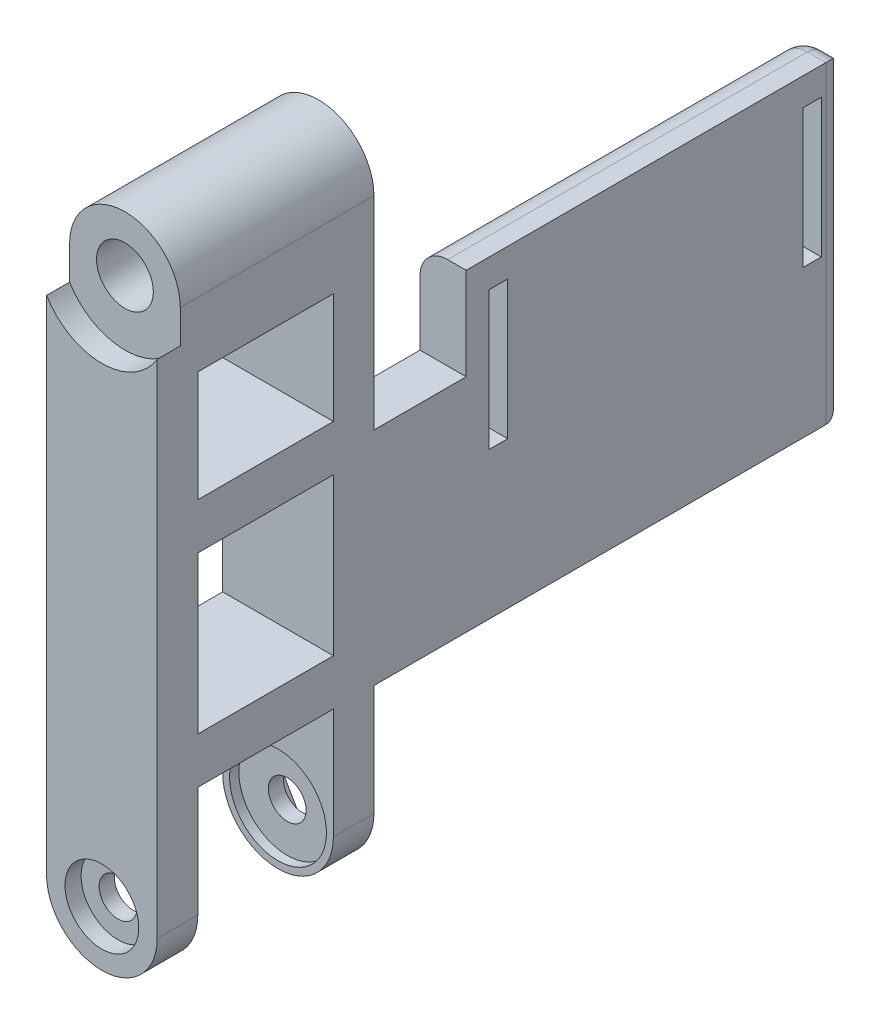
ISO-10303-21;
HEADER;
FILE_DESCRIPTION(('STEP AP214'),'2;1');
FILE_NAME('part.step','',(''),(''),'','','');
FILE_SCHEMA(('AUTOMOTIVE_DESIGN { 1 0 10303 214 1 1 1 1 }'));
ENDSEC;
DATA;
#1=APPLICATION_CONTEXT('core data for automotive mechanical design processes');
#2=APPLICATION_PROTOCOL_DEFINITION('international standard','automotive_design',2000,#1);
#3=PRODUCT_CONTEXT('',#1,'mechanical');
#4=PRODUCT('Part','Part','',(#3));
#5=PRODUCT_RELATED_PRODUCT_CATEGORY('part','',(#4));
#6=PRODUCT_DEFINITION_FORMATION('','',#4);
#7=PRODUCT_DEFINITION_CONTEXT('part definition',#1,'design');
#8=PRODUCT_DEFINITION('design','',#6,#7);
#9=PRODUCT_DEFINITION_SHAPE('','',#8);
#10=(LENGTH_UNIT() NAMED_UNIT(*) SI_UNIT(.MILLI.,.METRE.));
#11=(NAMED_UNIT(*) PLANE_ANGLE_UNIT() SI_UNIT($,.RADIAN.));
#12=(NAMED_UNIT(*) SI_UNIT($,.STERADIAN.) SOLID_ANGLE_UNIT());
#13=UNCERTAINTY_MEASURE_WITH_UNIT(LENGTH_MEASURE(1.E-05),#10,'distance_accuracy_value','');
#14=(GEOMETRIC_REPRESENTATION_CONTEXT(3) GLOBAL_UNCERTAINTY_ASSIGNED_CONTEXT((#13)) GLOBAL_UNIT_ASSIGNED_CONTEXT((#10,
#11,#12)) REPRESENTATION_CONTEXT('',''));
#15=CARTESIAN_POINT('',(0.,0.,0.));
#16=DIRECTION('',(0.,0.,1.));
#17=DIRECTION('',(1.,0.,0.));
#18=AXIS2_PLACEMENT_3D('',#15,#16,#17);
#19=CARTESIAN_POINT('',(12.,36.,-75.5));
#20=DIRECTION('',(0.,-1.,0.));
#21=DIRECTION('',(0.,0.,-1.));
#22=AXIS2_PLACEMENT_3D('',#19,#20,#21);
#23=PLANE('',#22);
#24=DIRECTION('',(1.,0.,0.));
#25=VECTOR('',#24,1.);
#26=CARTESIAN_POINT('',(7.,36.,-34.5));
#27=LINE('',#26,#25);
#28=CARTESIAN_POINT('',(7.,36.,-34.5));
#29=VERTEX_POINT('',#28);
#30=CARTESIAN_POINT('',(12.,36.,-34.5));
#31=VERTEX_POINT('',#30);
#32=EDGE_CURVE('E381',#29,#31,#27,.T.);
#33=ORIENTED_EDGE('',*,*,#32,.F.);
#34=DIRECTION('',(0.,0.,1.));
#35=VECTOR('',#34,1.);
#36=CARTESIAN_POINT('',(7.,36.,-75.5));
#37=LINE('',#36,#35);
#38=CARTESIAN_POINT('',(7.,36.,-24.5));
#39=VERTEX_POINT('',#38);
#40=EDGE_CURVE('E482',#29,#39,#37,.T.);
#41=ORIENTED_EDGE('',*,*,#40,.T.);
#42=DIRECTION('',(-1.,0.,0.));
#43=VECTOR('',#42,1.);
#44=CARTESIAN_POINT('',(12.,36.,-24.5));
#45=LINE('',#44,#43);
#46=CARTESIAN_POINT('',(12.,36.,-24.5));
#47=VERTEX_POINT('',#46);
#48=EDGE_CURVE('E432',#47,#39,#45,.T.);
#49=ORIENTED_EDGE('',*,*,#48,.F.);
#50=DIRECTION('',(0.,0.,1.));
#51=VECTOR('',#50,1.);
#52=CARTESIAN_POINT('',(12.,36.,-75.5));
#53=LINE('',#52,#51);
#54=EDGE_CURVE('E480',#31,#47,#53,.T.);
#55=ORIENTED_EDGE('',*,*,#54,.F.);
#56=EDGE_LOOP('',(#33,#41,#49,#55));
#57=FACE_BOUND('',#56,.T.);
#58=ADVANCED_FACE('F41',(#57),#23,.F.);
#59=CARTESIAN_POINT('',(6.,0.,-25.5));
#60=DIRECTION('',(0.,0.,1.));
#61=DIRECTION('',(1.,0.,0.));
#62=AXIS2_PLACEMENT_3D('',#59,#60,#61);
#63=CYLINDRICAL_SURFACE('',#62,2.05);
#64=CARTESIAN_POINT('',(6.,0.,-22.75));
#65=DIRECTION('',(0.,0.,-1.));
#66=DIRECTION('',(-1.,0.,0.));
#67=AXIS2_PLACEMENT_3D('',#64,#65,#66);
#68=CIRCLE('',#67,2.05);
#69=CARTESIAN_POINT('',(3.95,0.,-22.75));
#70=VERTEX_POINT('',#69);
#71=EDGE_CURVE('E486',#70,#70,#68,.F.);
#72=ORIENTED_EDGE('',*,*,#71,.F.);
#73=EDGE_LOOP('',(#72));
#74=FACE_BOUND('',#73,.T.);
#75=CARTESIAN_POINT('',(6.,0.,-21.1));
#76=DIRECTION('',(0.,0.,1.));
#77=DIRECTION('',(1.,0.,0.));
#78=AXIS2_PLACEMENT_3D('',#75,#76,#77);
#79=CIRCLE('',#78,2.05);
#80=CARTESIAN_POINT('',(8.05,0.,-21.1));
#81=VERTEX_POINT('',#80);
#82=EDGE_CURVE('E422',#81,#81,#79,.F.);
#83=ORIENTED_EDGE('',*,*,#82,.F.);
#84=EDGE_LOOP('',(#83));
#85=FACE_BOUND('',#84,.T.);
#86=ADVANCED_FACE('F736',(#74,#85),#63,.F.);
#87=CARTESIAN_POINT('',(6.,0.,-2.75));
#88=DIRECTION('',(0.,0.,1.));
#89=DIRECTION('',(1.,0.,0.));
#90=AXIS2_PLACEMENT_3D('',#87,#88,#89);
#91=CIRCLE('',#90,2.05);
#92=CARTESIAN_POINT('',(8.05,0.,-2.75));
#93=VERTEX_POINT('',#92);
#94=EDGE_CURVE('E524',#93,#93,#91,.F.);
#95=ORIENTED_EDGE('',*,*,#94,.F.);
#96=EDGE_LOOP('',(#95));
#97=FACE_BOUND('',#96,.T.);
#98=CARTESIAN_POINT('',(6.,0.,-4.4));
#99=DIRECTION('',(0.,0.,-1.));
#100=DIRECTION('',(-1.,0.,0.));
#101=AXIS2_PLACEMENT_3D('',#98,#99,#100);
#102=CIRCLE('',#101,2.05);
#103=CARTESIAN_POINT('',(3.95,0.,-4.4));
#104=VERTEX_POINT('',#103);
#105=EDGE_CURVE('E428',#104,#104,#102,.F.);
#106=ORIENTED_EDGE('',*,*,#105,.F.);
#107=EDGE_LOOP('',(#106));
#108=FACE_BOUND('',#107,.T.);
#109=ADVANCED_FACE('F743',(#97,#108),#63,.F.);
#110=CARTESIAN_POINT('',(0.,0.,-25.5));
#111=DIRECTION('',(-1.,0.,0.));
#112=DIRECTION('',(0.,-1.,0.));
#113=AXIS2_PLACEMENT_3D('',#110,#111,#112);
#114=PLANE('',#113);
#115=DIRECTION('',(0.,1.,0.));
#116=VECTOR('',#115,1.);
#117=CARTESIAN_POINT('',(0.,0.,-5.4));
#118=LINE('',#117,#116);
#119=CARTESIAN_POINT('',(0.,17.,-5.4));
#120=VERTEX_POINT('',#119);
#121=CARTESIAN_POINT('',(0.,34.,-5.4));
#122=VERTEX_POINT('',#121);
#123=EDGE_CURVE('E566',#120,#122,#118,.T.);
#124=ORIENTED_EDGE('',*,*,#123,.F.);
#125=DIRECTION('',(0.,0.,1.));
#126=VECTOR('',#125,1.);
#127=CARTESIAN_POINT('',(0.,17.,-25.5));
#128=LINE('',#127,#126);
#129=CARTESIAN_POINT('',(0.,17.,-20.1));
#130=VERTEX_POINT('',#129);
#131=EDGE_CURVE('E559',#130,#120,#128,.T.);
#132=ORIENTED_EDGE('',*,*,#131,.F.);
#133=DIRECTION('',(0.,-1.,0.));
#134=VECTOR('',#133,1.);
#135=CARTESIAN_POINT('',(0.,0.,-20.1));
#136=LINE('',#135,#134);
#137=CARTESIAN_POINT('',(0.,34.,-20.1));
#138=VERTEX_POINT('',#137);
#139=EDGE_CURVE('E561',#138,#130,#136,.T.);
#140=ORIENTED_EDGE('',*,*,#139,.F.);
#141=DIRECTION('',(0.,0.,-1.));
#142=VECTOR('',#141,1.);
#143=CARTESIAN_POINT('',(0.,34.,-25.5));
#144=LINE('',#143,#142);
#145=EDGE_CURVE('E564',#122,#138,#144,.T.);
#146=ORIENTED_EDGE('',*,*,#145,.F.);
#147=EDGE_LOOP('',(#124,#132,#140,#146));
#148=FACE_BOUND('',#147,.T.);
#149=DIRECTION('',(0.,1.,0.));
#150=VECTOR('',#149,1.);
#151=CARTESIAN_POINT('',(0.,0.,-5.4));
#152=LINE('',#151,#150);
#153=CARTESIAN_POINT('',(0.,39.,-5.4));
#154=VERTEX_POINT('',#153);
#155=CARTESIAN_POINT('',(0.,51.,-5.4));
#156=VERTEX_POINT('',#155);
#157=EDGE_CURVE('E557',#154,#156,#152,.T.);
#158=ORIENTED_EDGE('',*,*,#157,.F.);
#159=DIRECTION('',(0.,0.,1.));
#160=VECTOR('',#159,1.);
#161=CARTESIAN_POINT('',(0.,39.,-25.5));
#162=LINE('',#161,#160);
#163=CARTESIAN_POINT('',(0.,39.,-20.1));
#164=VERTEX_POINT('',#163);
#165=EDGE_CURVE('E550',#164,#154,#162,.T.);
#166=ORIENTED_EDGE('',*,*,#165,.F.);
#167=DIRECTION('',(0.,-1.,0.));
#168=VECTOR('',#167,1.);
#169=CARTESIAN_POINT('',(0.,0.,-20.1));
#170=LINE('',#169,#168);
#171=CARTESIAN_POINT('',(0.,51.,-20.1));
#172=VERTEX_POINT('',#171);
#173=EDGE_CURVE('E552',#172,#164,#170,.T.);
#174=ORIENTED_EDGE('',*,*,#173,.F.);
#175=DIRECTION('',(0.,0.,-1.));
#176=VECTOR('',#175,1.);
#177=CARTESIAN_POINT('',(0.,51.,-25.5));
#178=LINE('',#177,#176);
#179=EDGE_CURVE('E555',#156,#172,#178,.T.);
#180=ORIENTED_EDGE('',*,*,#179,.F.);
#181=EDGE_LOOP('',(#158,#166,#174,#180));
#182=FACE_BOUND('',#181,.T.);
#183=DIRECTION('',(0.,-1.,0.));
#184=VECTOR('',#183,1.);
#185=CARTESIAN_POINT('',(0.,0.,-24.5));
#186=LINE('',#185,#184);
#187=CARTESIAN_POINT('',(0.,58.,-24.5));
#188=VERTEX_POINT('',#187);
#189=CARTESIAN_POINT('',(0.,0.,-24.5));
#190=VERTEX_POINT('',#189);
#191=EDGE_CURVE('E457',#188,#190,#186,.T.);
#192=ORIENTED_EDGE('',*,*,#191,.T.);
#193=DIRECTION('',(0.,0.,1.));
#194=VECTOR('',#193,1.);
#195=CARTESIAN_POINT('',(0.,0.,-25.5));
#196=LINE('',#195,#194);
#197=CARTESIAN_POINT('',(0.,0.,-20.1));
#198=VERTEX_POINT('',#197);
#199=EDGE_CURVE('E571',#190,#198,#196,.T.);
#200=ORIENTED_EDGE('',*,*,#199,.T.);
#201=DIRECTION('',(0.,-1.,0.));
#202=VECTOR('',#201,1.);
#203=CARTESIAN_POINT('',(0.,0.,-20.1));
#204=LINE('',#203,#202);
#205=CARTESIAN_POINT('',(0.,12.,-20.1));
#206=VERTEX_POINT('',#205);
#207=EDGE_CURVE('E499',#206,#198,#204,.T.);
#208=ORIENTED_EDGE('',*,*,#207,.F.);
#209=DIRECTION('',(0.,0.,-1.));
#210=VECTOR('',#209,1.);
#211=CARTESIAN_POINT('',(0.,12.,-25.5));
#212=LINE('',#211,#210);
#213=CARTESIAN_POINT('',(0.,12.,-5.4));
#214=VERTEX_POINT('',#213);
#215=EDGE_CURVE('E568',#214,#206,#212,.T.);
#216=ORIENTED_EDGE('',*,*,#215,.F.);
#217=DIRECTION('',(0.,1.,0.));
#218=VECTOR('',#217,1.);
#219=CARTESIAN_POINT('',(0.,0.,-5.4));
#220=LINE('',#219,#218);
#221=CARTESIAN_POINT('',(0.,0.,-5.4));
#222=VERTEX_POINT('',#221);
#223=EDGE_CURVE('E546',#222,#214,#220,.T.);
#224=ORIENTED_EDGE('',*,*,#223,.F.);
#225=CARTESIAN_POINT('',(0.,0.,-1.));
#226=VERTEX_POINT('',#225);
#227=EDGE_CURVE('E574',#222,#226,#196,.T.);
#228=ORIENTED_EDGE('',*,*,#227,.T.);
#229=DIRECTION('',(0.,-1.,0.));
#230=VECTOR('',#229,1.);
#231=CARTESIAN_POINT('',(0.,0.,-1.));
#232=LINE('',#231,#230);
#233=CARTESIAN_POINT('',(0.,54.394448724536,-1.));
#234=VERTEX_POINT('',#233);
#235=EDGE_CURVE('E452',#234,#226,#232,.T.);
#236=ORIENTED_EDGE('',*,*,#235,.F.);
#237=DIRECTION('',(0.,0.,1.));
#238=VECTOR('',#237,1.);
#239=CARTESIAN_POINT('',(0.,54.394448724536,-3.5));
#240=LINE('',#239,#238);
#241=CARTESIAN_POINT('',(0.,54.394448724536,-3.5));
#242=VERTEX_POINT('',#241);
#243=EDGE_CURVE('E477',#242,#234,#240,.T.);
#244=ORIENTED_EDGE('',*,*,#243,.F.);
#245=DIRECTION('',(0.,1.,0.));
#246=VECTOR('',#245,1.);
#247=CARTESIAN_POINT('',(0.,0.,-3.5));
#248=LINE('',#247,#246);
#249=CARTESIAN_POINT('',(0.,58.,-3.5));
#250=VERTEX_POINT('',#249);
#251=EDGE_CURVE('E472',#242,#250,#248,.T.);
#252=ORIENTED_EDGE('',*,*,#251,.T.);
#253=DIRECTION('',(0.,0.,1.));
#254=VECTOR('',#253,1.);
#255=CARTESIAN_POINT('',(0.,58.,-25.5));
#256=LINE('',#255,#254);
#257=EDGE_CURVE('E575',#188,#250,#256,.T.);
#258=ORIENTED_EDGE('',*,*,#257,.F.);
#259=EDGE_LOOP('',(#192,#200,#208,#216,#224,#228,#236,#244,#252,#258));
#260=FACE_BOUND('',#259,.T.);
#261=ADVANCED_FACE('F814',(#148,#182,#260),#114,.T.);
#262=CARTESIAN_POINT('',(6.,0.,-25.5));
#263=DIRECTION('',(0.,0.,1.));
#264=DIRECTION('',(1.,0.,0.));
#265=AXIS2_PLACEMENT_3D('',#262,#263,#264);
#266=CYLINDRICAL_SURFACE('',#265,6.);
#267=ORIENTED_EDGE('',*,*,#199,.F.);
#268=CARTESIAN_POINT('',(6.,0.,-24.5));
#269=DIRECTION('',(0.,0.,-1.));
#270=DIRECTION('',(-1.,0.,0.));
#271=AXIS2_PLACEMENT_3D('',#268,#269,#270);
#272=CIRCLE('',#271,6.);
#273=CARTESIAN_POINT('',(12.,0.,-24.5));
#274=VERTEX_POINT('',#273);
#275=EDGE_CURVE('E443',#274,#190,#272,.T.);
#276=ORIENTED_EDGE('',*,*,#275,.F.);
#277=DIRECTION('',(0.,0.,1.));
#278=VECTOR('',#277,1.);
#279=CARTESIAN_POINT('',(12.,0.,-25.5));
#280=LINE('',#279,#278);
#281=CARTESIAN_POINT('',(12.,0.,-20.1));
#282=VERTEX_POINT('',#281);
#283=EDGE_CURVE('E579',#274,#282,#280,.T.);
#284=ORIENTED_EDGE('',*,*,#283,.T.);
#285=CARTESIAN_POINT('',(6.,0.,-20.1));
#286=DIRECTION('',(0.,0.,-1.));
#287=DIRECTION('',(-1.,0.,0.));
#288=AXIS2_PLACEMENT_3D('',#285,#286,#287);
#289=CIRCLE('',#288,6.);
#290=EDGE_CURVE('E543',#198,#282,#289,.F.);
#291=ORIENTED_EDGE('',*,*,#290,.F.);
#292=EDGE_LOOP('',(#267,#276,#284,#291));
#293=FACE_BOUND('',#292,.T.);
#294=ADVANCED_FACE('F817',(#293),#266,.T.);
#295=CARTESIAN_POINT('',(12.,0.,-5.4));
#296=VERTEX_POINT('',#295);
#297=CARTESIAN_POINT('',(12.,0.,-1.));
#298=VERTEX_POINT('',#297);
#299=EDGE_CURVE('E570',#296,#298,#280,.T.);
#300=ORIENTED_EDGE('',*,*,#299,.T.);
#301=CARTESIAN_POINT('',(6.,0.,-1.));
#302=DIRECTION('',(0.,0.,1.));
#303=DIRECTION('',(1.,0.,0.));
#304=AXIS2_PLACEMENT_3D('',#301,#302,#303);
#305=CIRCLE('',#304,6.);
#306=EDGE_CURVE('E446',#226,#298,#305,.T.);
#307=ORIENTED_EDGE('',*,*,#306,.F.);
#308=ORIENTED_EDGE('',*,*,#227,.F.);
#309=CARTESIAN_POINT('',(6.,0.,-5.4));
#310=DIRECTION('',(0.,0.,1.));
#311=DIRECTION('',(1.,0.,0.));
#312=AXIS2_PLACEMENT_3D('',#309,#310,#311);
#313=CIRCLE('',#312,6.);
#314=EDGE_CURVE('E548',#296,#222,#313,.F.);
#315=ORIENTED_EDGE('',*,*,#314,.F.);
#316=EDGE_LOOP('',(#300,#307,#308,#315));
#317=FACE_BOUND('',#316,.T.);
#318=ADVANCED_FACE('F825',(#317),#266,.T.);
#319=CARTESIAN_POINT('',(12.,0.,-25.5));
#320=DIRECTION('',(1.,0.,0.));
#321=DIRECTION('',(0.,1.,0.));
#322=AXIS2_PLACEMENT_3D('',#319,#320,#321);
#323=PLANE('',#322);
#324=DIRECTION('',(0.,-1.,0.));
#325=VECTOR('',#324,1.);
#326=CARTESIAN_POINT('',(12.,42.9325037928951,-37.));
#327=LINE('',#326,#325);
#328=CARTESIAN_POINT('',(12.,42.9325037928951,-37.));
#329=VERTEX_POINT('',#328);
#330=CARTESIAN_POINT('',(12.,27.9325037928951,-37.));
#331=VERTEX_POINT('',#330);
#332=EDGE_CURVE('E366',#329,#331,#327,.T.);
#333=ORIENTED_EDGE('',*,*,#332,.F.);
#334=DIRECTION('',(0.,0.,1.));
#335=VECTOR('',#334,1.);
#336=CARTESIAN_POINT('',(12.,42.9325037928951,-37.));
#337=LINE('',#336,#335);
#338=CARTESIAN_POINT('',(12.,42.9325037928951,-39.));
#339=VERTEX_POINT('',#338);
#340=EDGE_CURVE('E375',#339,#329,#337,.T.);
#341=ORIENTED_EDGE('',*,*,#340,.F.);
#342=DIRECTION('',(0.,1.,0.));
#343=VECTOR('',#342,1.);
#344=CARTESIAN_POINT('',(12.,42.9325037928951,-39.));
#345=LINE('',#344,#343);
#346=CARTESIAN_POINT('',(12.,27.9325037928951,-39.));
#347=VERTEX_POINT('',#346);
#348=EDGE_CURVE('E372',#347,#339,#345,.T.);
#349=ORIENTED_EDGE('',*,*,#348,.F.);
#350=DIRECTION('',(0.,0.,-1.));
#351=VECTOR('',#350,1.);
#352=CARTESIAN_POINT('',(12.,27.9325037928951,-37.));
#353=LINE('',#352,#351);
#354=EDGE_CURVE('E368',#331,#347,#353,.T.);
#355=ORIENTED_EDGE('',*,*,#354,.F.);
#356=EDGE_LOOP('',(#333,#341,#349,#355));
#357=FACE_BOUND('',#356,.T.);
#358=DIRECTION('',(0.,-1.,0.));
#359=VECTOR('',#358,1.);
#360=CARTESIAN_POINT('',(12.,43.,-71.));
#361=LINE('',#360,#359);
#362=CARTESIAN_POINT('',(12.,43.,-71.));
#363=VERTEX_POINT('',#362);
#364=CARTESIAN_POINT('',(12.,28.,-71.));
#365=VERTEX_POINT('',#364);
#366=EDGE_CURVE('E369',#363,#365,#361,.T.);
#367=ORIENTED_EDGE('',*,*,#366,.F.);
#368=DIRECTION('',(0.,0.,1.));
#369=VECTOR('',#368,1.);
#370=CARTESIAN_POINT('',(12.,43.,-71.));
#371=LINE('',#370,#369);
#372=CARTESIAN_POINT('',(12.,43.,-73.));
#373=VERTEX_POINT('',#372);
#374=EDGE_CURVE('E391',#373,#363,#371,.T.);
#375=ORIENTED_EDGE('',*,*,#374,.F.);
#376=DIRECTION('',(0.,1.,0.));
#377=VECTOR('',#376,1.);
#378=CARTESIAN_POINT('',(12.,43.,-73.));
#379=LINE('',#378,#377);
#380=CARTESIAN_POINT('',(12.,28.,-73.));
#381=VERTEX_POINT('',#380);
#382=EDGE_CURVE('E400',#381,#373,#379,.T.);
#383=ORIENTED_EDGE('',*,*,#382,.F.);
#384=DIRECTION('',(0.,0.,-1.));
#385=VECTOR('',#384,1.);
#386=CARTESIAN_POINT('',(12.,28.,-71.));
#387=LINE('',#386,#385);
#388=EDGE_CURVE('E403',#365,#381,#387,.T.);
#389=ORIENTED_EDGE('',*,*,#388,.F.);
#390=EDGE_LOOP('',(#367,#375,#383,#389));
#391=FACE_BOUND('',#390,.T.);
#392=DIRECTION('',(0.,0.,1.));
#393=VECTOR('',#392,1.);
#394=CARTESIAN_POINT('',(12.,12.,-75.5));
#395=LINE('',#394,#393);
#396=CARTESIAN_POINT('',(12.,12.,-73.5));
#397=VERTEX_POINT('',#396);
#398=CARTESIAN_POINT('',(12.,12.,-24.5));
#399=VERTEX_POINT('',#398);
#400=EDGE_CURVE('E484',#397,#399,#395,.T.);
#401=ORIENTED_EDGE('',*,*,#400,.F.);
#402=DIRECTION('',(0.,-1.,0.));
#403=VECTOR('',#402,1.);
#404=CARTESIAN_POINT('',(12.,0.,-73.5));
#405=LINE('',#404,#403);
#406=CARTESIAN_POINT('',(12.,46.,-73.5));
#407=VERTEX_POINT('',#406);
#408=EDGE_CURVE('E50',#397,#407,#405,.F.);
#409=ORIENTED_EDGE('',*,*,#408,.T.);
#410=DIRECTION('',(0.,0.,-1.));
#411=VECTOR('',#410,1.);
#412=CARTESIAN_POINT('',(12.,46.,-75.5));
#413=LINE('',#412,#411);
#414=CARTESIAN_POINT('',(12.,46.,-34.5));
#415=VERTEX_POINT('',#414);
#416=EDGE_CURVE('E409',#415,#407,#413,.T.);
#417=ORIENTED_EDGE('',*,*,#416,.F.);
#418=DIRECTION('',(0.,-1.,0.));
#419=VECTOR('',#418,1.);
#420=CARTESIAN_POINT('',(12.,46.,-34.5));
#421=LINE('',#420,#419);
#422=EDGE_CURVE('E412',#415,#31,#421,.T.);
#423=ORIENTED_EDGE('',*,*,#422,.T.);
#424=ORIENTED_EDGE('',*,*,#54,.T.);
#425=DIRECTION('',(0.,1.,0.));
#426=VECTOR('',#425,1.);
#427=CARTESIAN_POINT('',(12.,0.,-24.5));
#428=LINE('',#427,#426);
#429=CARTESIAN_POINT('',(12.,58.,-24.5));
#430=VERTEX_POINT('',#429);
#431=EDGE_CURVE('E573',#47,#430,#428,.T.);
#432=ORIENTED_EDGE('',*,*,#431,.T.);
#433=DIRECTION('',(0.,0.,1.));
#434=VECTOR('',#433,1.);
#435=CARTESIAN_POINT('',(12.,58.,-25.5));
#436=LINE('',#435,#434);
#437=CARTESIAN_POINT('',(12.,58.,-3.5));
#438=VERTEX_POINT('',#437);
#439=EDGE_CURVE('E577',#430,#438,#436,.T.);
#440=ORIENTED_EDGE('',*,*,#439,.T.);
#441=DIRECTION('',(0.,-1.,0.));
#442=VECTOR('',#441,1.);
#443=CARTESIAN_POINT('',(12.,0.,-3.5));
#444=LINE('',#443,#442);
#445=CARTESIAN_POINT('',(12.,54.394448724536,-3.5));
#446=VERTEX_POINT('',#445);
#447=EDGE_CURVE('E466',#438,#446,#444,.T.);
#448=ORIENTED_EDGE('',*,*,#447,.T.);
#449=DIRECTION('',(0.,0.,1.));
#450=VECTOR('',#449,1.);
#451=CARTESIAN_POINT('',(12.,54.394448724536,-3.5));
#452=LINE('',#451,#450);
#453=CARTESIAN_POINT('',(12.,54.394448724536,-1.));
#454=VERTEX_POINT('',#453);
#455=EDGE_CURVE('E475',#454,#446,#452,.F.);
#456=ORIENTED_EDGE('',*,*,#455,.F.);
#457=DIRECTION('',(0.,1.,0.));
#458=VECTOR('',#457,1.);
#459=CARTESIAN_POINT('',(12.,54.394448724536,-1.));
#460=LINE('',#459,#458);
#461=EDGE_CURVE('E448',#298,#454,#460,.T.);
#462=ORIENTED_EDGE('',*,*,#461,.F.);
#463=ORIENTED_EDGE('',*,*,#299,.F.);
#464=DIRECTION('',(0.,-1.,0.));
#465=VECTOR('',#464,1.);
#466=CARTESIAN_POINT('',(12.,-6.,-5.4));
#467=LINE('',#466,#465);
#468=CARTESIAN_POINT('',(12.,12.,-5.4));
#469=VERTEX_POINT('',#468);
#470=EDGE_CURVE('E487',#469,#296,#467,.T.);
#471=ORIENTED_EDGE('',*,*,#470,.F.);
#472=DIRECTION('',(0.,0.,1.));
#473=VECTOR('',#472,1.);
#474=CARTESIAN_POINT('',(12.,12.,-5.4));
#475=LINE('',#474,#473);
#476=CARTESIAN_POINT('',(12.,12.,-20.1));
#477=VERTEX_POINT('',#476);
#478=EDGE_CURVE('E493',#477,#469,#475,.T.);
#479=ORIENTED_EDGE('',*,*,#478,.F.);
#480=DIRECTION('',(0.,1.,0.));
#481=VECTOR('',#480,1.);
#482=CARTESIAN_POINT('',(12.,-6.,-20.1));
#483=LINE('',#482,#481);
#484=EDGE_CURVE('E489',#282,#477,#483,.T.);
#485=ORIENTED_EDGE('',*,*,#484,.F.);
#486=ORIENTED_EDGE('',*,*,#283,.F.);
#487=DIRECTION('',(0.,-1.,0.));
#488=VECTOR('',#487,1.);
#489=CARTESIAN_POINT('',(12.,12.,-24.5));
#490=LINE('',#489,#488);
#491=EDGE_CURVE('E441',#399,#274,#490,.T.);
#492=ORIENTED_EDGE('',*,*,#491,.F.);
#493=EDGE_LOOP('',(#401,#409,#417,#423,#424,#432,#440,#448,#456,#462,#463,#471,#479,#485,#486,#492));
#494=FACE_BOUND('',#493,.T.);
#495=DIRECTION('',(0.,-1.,0.));
#496=VECTOR('',#495,1.);
#497=CARTESIAN_POINT('',(12.,17.,-5.4));
#498=LINE('',#497,#496);
#499=CARTESIAN_POINT('',(12.,34.,-5.4));
#500=VERTEX_POINT('',#499);
#501=CARTESIAN_POINT('',(12.,17.,-5.4));
#502=VERTEX_POINT('',#501);
#503=EDGE_CURVE('E501',#500,#502,#498,.T.);
#504=ORIENTED_EDGE('',*,*,#503,.F.);
#505=DIRECTION('',(0.,0.,1.));
#506=VECTOR('',#505,1.);
#507=CARTESIAN_POINT('',(12.,34.,-5.4));
#508=LINE('',#507,#506);
#509=CARTESIAN_POINT('',(12.,34.,-20.1));
#510=VERTEX_POINT('',#509);
#511=EDGE_CURVE('E510',#510,#500,#508,.T.);
#512=ORIENTED_EDGE('',*,*,#511,.F.);
#513=DIRECTION('',(0.,1.,0.));
#514=VECTOR('',#513,1.);
#515=CARTESIAN_POINT('',(12.,17.,-20.1));
#516=LINE('',#515,#514);
#517=CARTESIAN_POINT('',(12.,17.,-20.1));
#518=VERTEX_POINT('',#517);
#519=EDGE_CURVE('E507',#518,#510,#516,.T.);
#520=ORIENTED_EDGE('',*,*,#519,.F.);
#521=DIRECTION('',(0.,0.,-1.));
#522=VECTOR('',#521,1.);
#523=CARTESIAN_POINT('',(12.,17.,-5.4));
#524=LINE('',#523,#522);
#525=EDGE_CURVE('E503',#502,#518,#524,.T.);
#526=ORIENTED_EDGE('',*,*,#525,.F.);
#527=EDGE_LOOP('',(#504,#512,#520,#526));
#528=FACE_BOUND('',#527,.T.);
#529=DIRECTION('',(0.,-1.,0.));
#530=VECTOR('',#529,1.);
#531=CARTESIAN_POINT('',(12.,39.,-5.4));
#532=LINE('',#531,#530);
#533=CARTESIAN_POINT('',(12.,51.,-5.4));
#534=VERTEX_POINT('',#533);
#535=CARTESIAN_POINT('',(12.,39.,-5.4));
#536=VERTEX_POINT('',#535);
#537=EDGE_CURVE('E521',#534,#536,#532,.T.);
#538=ORIENTED_EDGE('',*,*,#537,.F.);
#539=DIRECTION('',(0.,0.,1.));
#540=VECTOR('',#539,1.);
#541=CARTESIAN_POINT('',(12.,51.,-5.4));
#542=LINE('',#541,#540);
#543=CARTESIAN_POINT('',(12.,51.,-20.1));
#544=VERTEX_POINT('',#543);
#545=EDGE_CURVE('E530',#544,#534,#542,.T.);
#546=ORIENTED_EDGE('',*,*,#545,.F.);
#547=DIRECTION('',(0.,1.,0.));
#548=VECTOR('',#547,1.);
#549=CARTESIAN_POINT('',(12.,39.,-20.1));
#550=LINE('',#549,#548);
#551=CARTESIAN_POINT('',(12.,39.,-20.1));
#552=VERTEX_POINT('',#551);
#553=EDGE_CURVE('E527',#552,#544,#550,.T.);
#554=ORIENTED_EDGE('',*,*,#553,.F.);
#555=DIRECTION('',(0.,0.,-1.));
#556=VECTOR('',#555,1.);
#557=CARTESIAN_POINT('',(12.,39.,-5.4));
#558=LINE('',#557,#556);
#559=EDGE_CURVE('E523',#536,#552,#558,.T.);
#560=ORIENTED_EDGE('',*,*,#559,.F.);
#561=EDGE_LOOP('',(#538,#546,#554,#560));
#562=FACE_BOUND('',#561,.T.);
#563=ADVANCED_FACE('F701',(#357,#391,#494,#528,#562),#323,.T.);
#564=CARTESIAN_POINT('',(5.99999999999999,58.,-3.5));
#565=DIRECTION('',(0.,0.,1.));
#566=DIRECTION('',(1.,0.,0.));
#567=AXIS2_PLACEMENT_3D('',#564,#565,#566);
#568=CYLINDRICAL_SURFACE('',#567,7.);
#569=CARTESIAN_POINT('',(5.99999999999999,58.,-1.));
#570=DIRECTION('',(0.,0.,-1.));
#571=DIRECTION('',(1.,0.,0.));
#572=AXIS2_PLACEMENT_3D('',#569,#570,#571);
#573=CIRCLE('',#572,7.);
#574=EDGE_CURVE('E450',#454,#234,#573,.T.);
#575=ORIENTED_EDGE('',*,*,#574,.F.);
#576=ORIENTED_EDGE('',*,*,#455,.T.);
#577=CARTESIAN_POINT('',(5.99999999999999,58.,-3.5));
#578=DIRECTION('',(0.,0.,1.));
#579=DIRECTION('',(1.,0.,0.));
#580=AXIS2_PLACEMENT_3D('',#577,#578,#579);
#581=CIRCLE('',#580,7.);
#582=EDGE_CURVE('E462',#242,#446,#581,.T.);
#583=ORIENTED_EDGE('',*,*,#582,.F.);
#584=ORIENTED_EDGE('',*,*,#243,.T.);
#585=EDGE_LOOP('',(#575,#576,#583,#584));
#586=FACE_BOUND('',#585,.T.);
#587=ADVANCED_FACE('F821',(#586),#568,.F.);
#588=CARTESIAN_POINT('',(5.99999999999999,58.,-25.5));
#589=DIRECTION('',(0.,0.,1.));
#590=DIRECTION('',(1.,0.,0.));
#591=AXIS2_PLACEMENT_3D('',#588,#589,#590);
#592=CYLINDRICAL_SURFACE('',#591,6.);
#593=ORIENTED_EDGE('',*,*,#439,.F.);
#594=CARTESIAN_POINT('',(5.99999999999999,58.,-24.5));
#595=DIRECTION('',(0.,0.,-1.));
#596=DIRECTION('',(-1.,0.,0.));
#597=AXIS2_PLACEMENT_3D('',#594,#595,#596);
#598=CIRCLE('',#597,6.);
#599=EDGE_CURVE('E454',#430,#188,#598,.F.);
#600=ORIENTED_EDGE('',*,*,#599,.T.);
#601=ORIENTED_EDGE('',*,*,#257,.T.);
#602=CARTESIAN_POINT('',(5.99999999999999,58.,-3.5));
#603=DIRECTION('',(0.,0.,1.));
#604=DIRECTION('',(1.,0.,0.));
#605=AXIS2_PLACEMENT_3D('',#602,#603,#604);
#606=CIRCLE('',#605,6.);
#607=EDGE_CURVE('E469',#250,#438,#606,.F.);
#608=ORIENTED_EDGE('',*,*,#607,.T.);
#609=EDGE_LOOP('',(#593,#600,#601,#608));
#610=FACE_BOUND('',#609,.T.);
#611=ADVANCED_FACE('F812',(#610),#592,.T.);
#612=CARTESIAN_POINT('',(5.99999999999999,58.,-25.5));
#613=DIRECTION('',(0.,0.,1.));
#614=DIRECTION('',(1.,0.,0.));
#615=AXIS2_PLACEMENT_3D('',#612,#613,#614);
#616=CYLINDRICAL_SURFACE('',#615,3.08);
#617=CARTESIAN_POINT('',(5.99999999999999,58.,-3.5));
#618=DIRECTION('',(0.,0.,1.));
#619=DIRECTION('',(1.,0.,0.));
#620=AXIS2_PLACEMENT_3D('',#617,#618,#619);
#621=CIRCLE('',#620,3.08);
#622=CARTESIAN_POINT('',(9.07999999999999,58.,-3.5));
#623=VERTEX_POINT('',#622);
#624=EDGE_CURVE('E465',#623,#623,#621,.F.);
#625=ORIENTED_EDGE('',*,*,#624,.F.);
#626=EDGE_LOOP('',(#625));
#627=FACE_BOUND('',#626,.T.);
#628=CARTESIAN_POINT('',(5.99999999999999,58.,-24.5));
#629=DIRECTION('',(0.,0.,-1.));
#630=DIRECTION('',(-1.,0.,0.));
#631=AXIS2_PLACEMENT_3D('',#628,#629,#630);
#632=CIRCLE('',#631,3.08);
#633=CARTESIAN_POINT('',(2.91999999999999,58.,-24.5));
#634=VERTEX_POINT('',#633);
#635=EDGE_CURVE('E459',#634,#634,#632,.F.);
#636=ORIENTED_EDGE('',*,*,#635,.F.);
#637=EDGE_LOOP('',(#636));
#638=FACE_BOUND('',#637,.T.);
#639=ADVANCED_FACE('F778',(#627,#638),#616,.F.);
#640=CARTESIAN_POINT('',(-8.,-6.,-5.4));
#641=DIRECTION('',(0.,0.,1.));
#642=DIRECTION('',(1.,0.,0.));
#643=AXIS2_PLACEMENT_3D('',#640,#641,#642);
#644=PLANE('',#643);
#645=CARTESIAN_POINT('',(6.,0.,-5.4));
#646=DIRECTION('',(0.,0.,-1.));
#647=DIRECTION('',(-1.,0.,0.));
#648=AXIS2_PLACEMENT_3D('',#645,#646,#647);
#649=CIRCLE('',#648,5.25);
#650=CARTESIAN_POINT('',(0.75,0.,-5.4));
#651=VERTEX_POINT('',#650);
#652=EDGE_CURVE('E429',#651,#651,#649,.T.);
#653=ORIENTED_EDGE('',*,*,#652,.F.);
#654=EDGE_LOOP('',(#653));
#655=FACE_BOUND('',#654,.T.);
#656=ORIENTED_EDGE('',*,*,#314,.T.);
#657=ORIENTED_EDGE('',*,*,#223,.T.);
#658=DIRECTION('',(1.,0.,0.));
#659=VECTOR('',#658,1.);
#660=CARTESIAN_POINT('',(-8.,12.,-5.4));
#661=LINE('',#660,#659);
#662=EDGE_CURVE('E497',#214,#469,#661,.T.);
#663=ORIENTED_EDGE('',*,*,#662,.T.);
#664=ORIENTED_EDGE('',*,*,#470,.T.);
#665=EDGE_LOOP('',(#656,#657,#663,#664));
#666=FACE_BOUND('',#665,.T.);
#667=ADVANCED_FACE('F774',(#655,#666),#644,.F.);
#668=CARTESIAN_POINT('',(-8.,-6.,-20.1));
#669=DIRECTION('',(0.,0.,-1.));
#670=DIRECTION('',(-1.,0.,0.));
#671=AXIS2_PLACEMENT_3D('',#668,#669,#670);
#672=PLANE('',#671);
#673=CARTESIAN_POINT('',(6.,0.,-20.1));
#674=DIRECTION('',(0.,0.,1.));
#675=DIRECTION('',(1.,0.,0.));
#676=AXIS2_PLACEMENT_3D('',#673,#674,#675);
#677=CIRCLE('',#676,5.25);
#678=CARTESIAN_POINT('',(11.25,0.,-20.1));
#679=VERTEX_POINT('',#678);
#680=EDGE_CURVE('E418',#679,#679,#677,.T.);
#681=ORIENTED_EDGE('',*,*,#680,.F.);
#682=EDGE_LOOP('',(#681));
#683=FACE_BOUND('',#682,.T.);
#684=ORIENTED_EDGE('',*,*,#290,.T.);
#685=ORIENTED_EDGE('',*,*,#484,.T.);
#686=DIRECTION('',(1.,0.,0.));
#687=VECTOR('',#686,1.);
#688=CARTESIAN_POINT('',(-8.,12.,-20.1));
#689=LINE('',#688,#687);
#690=EDGE_CURVE('E496',#206,#477,#689,.T.);
#691=ORIENTED_EDGE('',*,*,#690,.F.);
#692=ORIENTED_EDGE('',*,*,#207,.T.);
#693=EDGE_LOOP('',(#684,#685,#691,#692));
#694=FACE_BOUND('',#693,.T.);
#695=ADVANCED_FACE('F770',(#683,#694),#672,.F.);
#696=CARTESIAN_POINT('',(-8.,12.,-5.4));
#697=DIRECTION('',(0.,1.,0.));
#698=DIRECTION('',(-1.,0.,0.));
#699=AXIS2_PLACEMENT_3D('',#696,#697,#698);
#700=PLANE('',#699);
#701=ORIENTED_EDGE('',*,*,#215,.T.);
#702=ORIENTED_EDGE('',*,*,#690,.T.);
#703=ORIENTED_EDGE('',*,*,#478,.T.);
#704=ORIENTED_EDGE('',*,*,#662,.F.);
#705=EDGE_LOOP('',(#701,#702,#703,#704));
#706=FACE_BOUND('',#705,.T.);
#707=ADVANCED_FACE('F766',(#706),#700,.F.);
#708=CARTESIAN_POINT('',(-8.00000000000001,39.,-5.4));
#709=DIRECTION('',(0.,0.,1.));
#710=DIRECTION('',(1.,0.,0.));
#711=AXIS2_PLACEMENT_3D('',#708,#709,#710);
#712=PLANE('',#711);
#713=ORIENTED_EDGE('',*,*,#157,.T.);
#714=DIRECTION('',(1.,0.,0.));
#715=VECTOR('',#714,1.);
#716=CARTESIAN_POINT('',(-8.00000000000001,51.,-5.4));
#717=LINE('',#716,#715);
#718=EDGE_CURVE('E504',#156,#534,#717,.T.);
#719=ORIENTED_EDGE('',*,*,#718,.T.);
#720=ORIENTED_EDGE('',*,*,#537,.T.);
#721=DIRECTION('',(1.,0.,0.));
#722=VECTOR('',#721,1.);
#723=CARTESIAN_POINT('',(-8.00000000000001,39.,-5.4));
#724=LINE('',#723,#722);
#725=EDGE_CURVE('E533',#154,#536,#724,.T.);
#726=ORIENTED_EDGE('',*,*,#725,.F.);
#727=EDGE_LOOP('',(#713,#719,#720,#726));
#728=FACE_BOUND('',#727,.T.);
#729=ADVANCED_FACE('F769',(#728),#712,.F.);
#730=CARTESIAN_POINT('',(-8.00000000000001,51.,-5.4));
#731=DIRECTION('',(0.,1.,0.));
#732=DIRECTION('',(-1.,0.,0.));
#733=AXIS2_PLACEMENT_3D('',#730,#731,#732);
#734=PLANE('',#733);
#735=ORIENTED_EDGE('',*,*,#179,.T.);
#736=DIRECTION('',(1.,0.,0.));
#737=VECTOR('',#736,1.);
#738=CARTESIAN_POINT('',(-8.00000000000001,51.,-20.1));
#739=LINE('',#738,#737);
#740=EDGE_CURVE('E535',#172,#544,#739,.T.);
#741=ORIENTED_EDGE('',*,*,#740,.T.);
#742=ORIENTED_EDGE('',*,*,#545,.T.);
#743=ORIENTED_EDGE('',*,*,#718,.F.);
#744=EDGE_LOOP('',(#735,#741,#742,#743));
#745=FACE_BOUND('',#744,.T.);
#746=ADVANCED_FACE('F796',(#745),#734,.F.);
#747=CARTESIAN_POINT('',(-8.00000000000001,39.,-20.1));
#748=DIRECTION('',(0.,0.,-1.));
#749=DIRECTION('',(-1.,0.,0.));
#750=AXIS2_PLACEMENT_3D('',#747,#748,#749);
#751=PLANE('',#750);
#752=ORIENTED_EDGE('',*,*,#173,.T.);
#753=DIRECTION('',(1.,0.,0.));
#754=VECTOR('',#753,1.);
#755=CARTESIAN_POINT('',(-8.00000000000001,39.,-20.1));
#756=LINE('',#755,#754);
#757=EDGE_CURVE('E537',#164,#552,#756,.T.);
#758=ORIENTED_EDGE('',*,*,#757,.T.);
#759=ORIENTED_EDGE('',*,*,#553,.T.);
#760=ORIENTED_EDGE('',*,*,#740,.F.);
#761=EDGE_LOOP('',(#752,#758,#759,#760));
#762=FACE_BOUND('',#761,.T.);
#763=ADVANCED_FACE('F799',(#762),#751,.F.);
#764=CARTESIAN_POINT('',(-8.00000000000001,39.,-5.4));
#765=DIRECTION('',(0.,-1.,0.));
#766=DIRECTION('',(1.,0.,0.));
#767=AXIS2_PLACEMENT_3D('',#764,#765,#766);
#768=PLANE('',#767);
#769=ORIENTED_EDGE('',*,*,#165,.T.);
#770=ORIENTED_EDGE('',*,*,#725,.T.);
#771=ORIENTED_EDGE('',*,*,#559,.T.);
#772=ORIENTED_EDGE('',*,*,#757,.F.);
#773=EDGE_LOOP('',(#769,#770,#771,#772));
#774=FACE_BOUND('',#773,.T.);
#775=ADVANCED_FACE('F794',(#774),#768,.F.);
#776=CARTESIAN_POINT('',(-8.,17.,-5.4));
#777=DIRECTION('',(0.,0.,1.));
#778=DIRECTION('',(1.,0.,0.));
#779=AXIS2_PLACEMENT_3D('',#776,#777,#778);
#780=PLANE('',#779);
#781=ORIENTED_EDGE('',*,*,#123,.T.);
#782=DIRECTION('',(1.,0.,0.));
#783=VECTOR('',#782,1.);
#784=CARTESIAN_POINT('',(-8.00000000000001,34.,-5.4));
#785=LINE('',#784,#783);
#786=EDGE_CURVE('E490',#122,#500,#785,.T.);
#787=ORIENTED_EDGE('',*,*,#786,.T.);
#788=ORIENTED_EDGE('',*,*,#503,.T.);
#789=DIRECTION('',(1.,0.,0.));
#790=VECTOR('',#789,1.);
#791=CARTESIAN_POINT('',(-8.,17.,-5.4));
#792=LINE('',#791,#790);
#793=EDGE_CURVE('E513',#120,#502,#792,.T.);
#794=ORIENTED_EDGE('',*,*,#793,.F.);
#795=EDGE_LOOP('',(#781,#787,#788,#794));
#796=FACE_BOUND('',#795,.T.);
#797=ADVANCED_FACE('F784',(#796),#780,.F.);
#798=CARTESIAN_POINT('',(-8.00000000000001,34.,-5.4));
#799=DIRECTION('',(0.,1.,0.));
#800=DIRECTION('',(-1.,0.,0.));
#801=AXIS2_PLACEMENT_3D('',#798,#799,#800);
#802=PLANE('',#801);
#803=ORIENTED_EDGE('',*,*,#145,.T.);
#804=DIRECTION('',(1.,0.,0.));
#805=VECTOR('',#804,1.);
#806=CARTESIAN_POINT('',(-8.00000000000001,34.,-20.1));
#807=LINE('',#806,#805);
#808=EDGE_CURVE('E515',#138,#510,#807,.T.);
#809=ORIENTED_EDGE('',*,*,#808,.T.);
#810=ORIENTED_EDGE('',*,*,#511,.T.);
#811=ORIENTED_EDGE('',*,*,#786,.F.);
#812=EDGE_LOOP('',(#803,#809,#810,#811));
#813=FACE_BOUND('',#812,.T.);
#814=ADVANCED_FACE('F780',(#813),#802,.F.);
#815=CARTESIAN_POINT('',(-8.,17.,-20.1));
#816=DIRECTION('',(0.,0.,-1.));
#817=DIRECTION('',(-1.,0.,0.));
#818=AXIS2_PLACEMENT_3D('',#815,#816,#817);
#819=PLANE('',#818);
#820=ORIENTED_EDGE('',*,*,#139,.T.);
#821=DIRECTION('',(1.,0.,0.));
#822=VECTOR('',#821,1.);
#823=CARTESIAN_POINT('',(-8.,17.,-20.1));
#824=LINE('',#823,#822);
#825=EDGE_CURVE('E517',#130,#518,#824,.T.);
#826=ORIENTED_EDGE('',*,*,#825,.T.);
#827=ORIENTED_EDGE('',*,*,#519,.T.);
#828=ORIENTED_EDGE('',*,*,#808,.F.);
#829=EDGE_LOOP('',(#820,#826,#827,#828));
#830=FACE_BOUND('',#829,.T.);
#831=ADVANCED_FACE('F783',(#830),#819,.F.);
#832=CARTESIAN_POINT('',(-8.,17.,-5.4));
#833=DIRECTION('',(0.,-1.,0.));
#834=DIRECTION('',(1.,0.,0.));
#835=AXIS2_PLACEMENT_3D('',#832,#833,#834);
#836=PLANE('',#835);
#837=ORIENTED_EDGE('',*,*,#131,.T.);
#838=ORIENTED_EDGE('',*,*,#793,.T.);
#839=ORIENTED_EDGE('',*,*,#525,.T.);
#840=ORIENTED_EDGE('',*,*,#825,.F.);
#841=EDGE_LOOP('',(#837,#838,#839,#840));
#842=FACE_BOUND('',#841,.T.);
#843=ADVANCED_FACE('F764',(#842),#836,.F.);
#844=CARTESIAN_POINT('',(6.,0.,-2.75));
#845=DIRECTION('',(0.,0.,1.));
#846=DIRECTION('',(1.,0.,0.));
#847=AXIS2_PLACEMENT_3D('',#844,#845,#846);
#848=PLANE('',#847);
#849=ORIENTED_EDGE('',*,*,#94,.T.);
#850=EDGE_LOOP('',(#849));
#851=FACE_BOUND('',#850,.T.);
#852=CARTESIAN_POINT('',(6.,0.,-2.75));
#853=DIRECTION('',(0.,0.,1.));
#854=DIRECTION('',(1.,0.,0.));
#855=AXIS2_PLACEMENT_3D('',#852,#853,#854);
#856=CIRCLE('',#855,4.);
#857=CARTESIAN_POINT('',(10.,0.,-2.75));
#858=VERTEX_POINT('',#857);
#859=EDGE_CURVE('E362',#858,#858,#856,.F.);
#860=ORIENTED_EDGE('',*,*,#859,.F.);
#861=EDGE_LOOP('',(#860));
#862=FACE_BOUND('',#861,.T.);
#863=ADVANCED_FACE('F760',(#851,#862),#848,.T.);
#864=CARTESIAN_POINT('',(0.,0.,-22.75));
#865=DIRECTION('',(0.,0.,-1.));
#866=DIRECTION('',(-1.,0.,0.));
#867=AXIS2_PLACEMENT_3D('',#864,#865,#866);
#868=PLANE('',#867);
#869=ORIENTED_EDGE('',*,*,#71,.T.);
#870=EDGE_LOOP('',(#869));
#871=FACE_BOUND('',#870,.T.);
#872=DIRECTION('',(0.5,-0.866025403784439,0.));
#873=VECTOR('',#872,1.);
#874=CARTESIAN_POINT('',(3.75,-3.89711431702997,-22.75));
#875=LINE('',#874,#873);
#876=CARTESIAN_POINT('',(1.5,0.,-22.75));
#877=VERTEX_POINT('',#876);
#878=CARTESIAN_POINT('',(3.75,-3.89711431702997,-22.75));
#879=VERTEX_POINT('',#878);
#880=EDGE_CURVE('E359',#877,#879,#875,.T.);
#881=ORIENTED_EDGE('',*,*,#880,.F.);
#882=DIRECTION('',(-0.5,-0.866025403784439,0.));
#883=VECTOR('',#882,1.);
#884=CARTESIAN_POINT('',(1.5,0.,-22.75));
#885=LINE('',#884,#883);
#886=CARTESIAN_POINT('',(3.75,3.89711431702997,-22.75));
#887=VERTEX_POINT('',#886);
#888=EDGE_CURVE('E356',#887,#877,#885,.T.);
#889=ORIENTED_EDGE('',*,*,#888,.F.);
#890=DIRECTION('',(-1.,0.,0.));
#891=VECTOR('',#890,1.);
#892=CARTESIAN_POINT('',(3.75,3.89711431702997,-22.75));
#893=LINE('',#892,#891);
#894=CARTESIAN_POINT('',(8.25,3.89711431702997,-22.75));
#895=VERTEX_POINT('',#894);
#896=EDGE_CURVE('E322',#895,#887,#893,.T.);
#897=ORIENTED_EDGE('',*,*,#896,.F.);
#898=DIRECTION('',(-0.5,0.866025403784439,0.));
#899=VECTOR('',#898,1.);
#900=CARTESIAN_POINT('',(8.25,3.89711431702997,-22.75));
#901=LINE('',#900,#899);
#902=CARTESIAN_POINT('',(10.5,0.,-22.75));
#903=VERTEX_POINT('',#902);
#904=EDGE_CURVE('E1410',#903,#895,#901,.T.);
#905=ORIENTED_EDGE('',*,*,#904,.F.);
#906=DIRECTION('',(0.5,0.866025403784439,0.));
#907=VECTOR('',#906,1.);
#908=CARTESIAN_POINT('',(10.5,0.,-22.75));
#909=LINE('',#908,#907);
#910=CARTESIAN_POINT('',(8.25,-3.89711431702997,-22.75));
#911=VERTEX_POINT('',#910);
#912=EDGE_CURVE('E1413',#911,#903,#909,.T.);
#913=ORIENTED_EDGE('',*,*,#912,.F.);
#914=DIRECTION('',(1.,0.,0.));
#915=VECTOR('',#914,1.);
#916=CARTESIAN_POINT('',(8.25,-3.89711431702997,-22.75));
#917=LINE('',#916,#915);
#918=EDGE_CURVE('E1419',#879,#911,#917,.T.);
#919=ORIENTED_EDGE('',*,*,#918,.F.);
#920=EDGE_LOOP('',(#881,#889,#897,#905,#913,#919));
#921=FACE_BOUND('',#920,.T.);
#922=ADVANCED_FACE('F756',(#871,#921),#868,.T.);
#923=CARTESIAN_POINT('',(12.,12.,-75.5));
#924=DIRECTION('',(0.,1.,0.));
#925=DIRECTION('',(0.,0.,1.));
#926=AXIS2_PLACEMENT_3D('',#923,#924,#925);
#927=PLANE('',#926);
#928=DIRECTION('',(0.,0.,1.));
#929=VECTOR('',#928,1.);
#930=CARTESIAN_POINT('',(10.,12.,-75.5));
#931=LINE('',#930,#929);
#932=CARTESIAN_POINT('',(10.,12.,-24.5));
#933=VERTEX_POINT('',#932);
#934=CARTESIAN_POINT('',(10.,12.,-73.5));
#935=VERTEX_POINT('',#934);
#936=EDGE_CURVE('E595',#933,#935,#931,.F.);
#937=ORIENTED_EDGE('',*,*,#936,.T.);
#938=DIRECTION('',(-1.,0.,0.));
#939=VECTOR('',#938,1.);
#940=CARTESIAN_POINT('',(12.,12.,-73.5));
#941=LINE('',#940,#939);
#942=EDGE_CURVE('E632',#935,#397,#941,.F.);
#943=ORIENTED_EDGE('',*,*,#942,.T.);
#944=ORIENTED_EDGE('',*,*,#400,.T.);
#945=DIRECTION('',(1.,0.,0.));
#946=VECTOR('',#945,1.);
#947=CARTESIAN_POINT('',(7.,12.,-24.5));
#948=LINE('',#947,#946);
#949=EDGE_CURVE('E438',#933,#399,#948,.T.);
#950=ORIENTED_EDGE('',*,*,#949,.F.);
#951=EDGE_LOOP('',(#937,#943,#944,#950));
#952=FACE_BOUND('',#951,.T.);
#953=ADVANCED_FACE('F752',(#952),#927,.F.);
#954=CARTESIAN_POINT('',(7.,36.,-75.5));
#955=DIRECTION('',(1.,0.,0.));
#956=DIRECTION('',(0.,1.,0.));
#957=AXIS2_PLACEMENT_3D('',#954,#955,#956);
#958=PLANE('',#957);
#959=DIRECTION('',(0.,0.,1.));
#960=VECTOR('',#959,1.);
#961=CARTESIAN_POINT('',(7.,42.9325037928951,-75.5));
#962=LINE('',#961,#960);
#963=CARTESIAN_POINT('',(7.,42.9325037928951,-39.));
#964=VERTEX_POINT('',#963);
#965=CARTESIAN_POINT('',(7.,42.9325037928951,-37.));
#966=VERTEX_POINT('',#965);
#967=EDGE_CURVE('E618',#964,#966,#962,.T.);
#968=ORIENTED_EDGE('',*,*,#967,.T.);
#969=DIRECTION('',(0.,-1.,0.));
#970=VECTOR('',#969,1.);
#971=CARTESIAN_POINT('',(7.,36.,-37.));
#972=LINE('',#971,#970);
#973=CARTESIAN_POINT('',(7.,27.9325037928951,-37.));
#974=VERTEX_POINT('',#973);
#975=EDGE_CURVE('E621',#966,#974,#972,.T.);
#976=ORIENTED_EDGE('',*,*,#975,.T.);
#977=DIRECTION('',(0.,0.,-1.));
#978=VECTOR('',#977,1.);
#979=CARTESIAN_POINT('',(7.,27.9325037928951,-75.5));
#980=LINE('',#979,#978);
#981=CARTESIAN_POINT('',(7.,27.9325037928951,-39.));
#982=VERTEX_POINT('',#981);
#983=EDGE_CURVE('E612',#974,#982,#980,.T.);
#984=ORIENTED_EDGE('',*,*,#983,.T.);
#985=DIRECTION('',(0.,1.,0.));
#986=VECTOR('',#985,1.);
#987=CARTESIAN_POINT('',(7.,36.,-39.));
#988=LINE('',#987,#986);
#989=EDGE_CURVE('E615',#982,#964,#988,.T.);
#990=ORIENTED_EDGE('',*,*,#989,.T.);
#991=EDGE_LOOP('',(#968,#976,#984,#990));
#992=FACE_BOUND('',#991,.T.);
#993=DIRECTION('',(0.,0.,1.));
#994=VECTOR('',#993,1.);
#995=CARTESIAN_POINT('',(7.,43.,-75.5));
#996=LINE('',#995,#994);
#997=CARTESIAN_POINT('',(7.,43.,-73.));
#998=VERTEX_POINT('',#997);
#999=CARTESIAN_POINT('',(7.,43.,-73.5));
#1000=VERTEX_POINT('',#999);
#1001=EDGE_CURVE('E628',#998,#1000,#996,.F.);
#1002=ORIENTED_EDGE('',*,*,#1001,.T.);
#1003=DIRECTION('',(0.,1.,0.));
#1004=VECTOR('',#1003,1.);
#1005=CARTESIAN_POINT('',(7.,15.,-73.5));
#1006=LINE('',#1005,#1004);
#1007=CARTESIAN_POINT('',(7.,15.,-73.5));
#1008=VERTEX_POINT('',#1007);
#1009=EDGE_CURVE('E11',#1000,#1008,#1006,.F.);
#1010=ORIENTED_EDGE('',*,*,#1009,.T.);
#1011=DIRECTION('',(0.,0.,1.));
#1012=VECTOR('',#1011,1.);
#1013=CARTESIAN_POINT('',(7.,15.,-75.5));
#1014=LINE('',#1013,#1012);
#1015=CARTESIAN_POINT('',(7.,15.,-24.5));
#1016=VERTEX_POINT('',#1015);
#1017=EDGE_CURVE('E589',#1008,#1016,#1014,.T.);
#1018=ORIENTED_EDGE('',*,*,#1017,.T.);
#1019=DIRECTION('',(0.,-1.,0.));
#1020=VECTOR('',#1019,1.);
#1021=CARTESIAN_POINT('',(7.,36.,-24.5));
#1022=LINE('',#1021,#1020);
#1023=EDGE_CURVE('E435',#39,#1016,#1022,.T.);
#1024=ORIENTED_EDGE('',*,*,#1023,.F.);
#1025=ORIENTED_EDGE('',*,*,#40,.F.);
#1026=DIRECTION('',(0.,-1.,0.));
#1027=VECTOR('',#1026,1.);
#1028=CARTESIAN_POINT('',(7.,46.,-34.5));
#1029=LINE('',#1028,#1027);
#1030=CARTESIAN_POINT('',(7.,43.,-34.5));
#1031=VERTEX_POINT('',#1030);
#1032=EDGE_CURVE('E416',#1031,#29,#1029,.T.);
#1033=ORIENTED_EDGE('',*,*,#1032,.F.);
#1034=DIRECTION('',(0.,0.,1.));
#1035=VECTOR('',#1034,1.);
#1036=CARTESIAN_POINT('',(7.,43.,-75.5));
#1037=LINE('',#1036,#1035);
#1038=CARTESIAN_POINT('',(7.,43.,-71.));
#1039=VERTEX_POINT('',#1038);
#1040=EDGE_CURVE('E630',#1031,#1039,#1037,.F.);
#1041=ORIENTED_EDGE('',*,*,#1040,.T.);
#1042=DIRECTION('',(0.,-1.,0.));
#1043=VECTOR('',#1042,1.);
#1044=CARTESIAN_POINT('',(7.,36.,-71.));
#1045=LINE('',#1044,#1043);
#1046=CARTESIAN_POINT('',(7.,28.,-71.));
#1047=VERTEX_POINT('',#1046);
#1048=EDGE_CURVE('E609',#1039,#1047,#1045,.T.);
#1049=ORIENTED_EDGE('',*,*,#1048,.T.);
#1050=DIRECTION('',(0.,0.,-1.));
#1051=VECTOR('',#1050,1.);
#1052=CARTESIAN_POINT('',(7.,28.,-75.5));
#1053=LINE('',#1052,#1051);
#1054=CARTESIAN_POINT('',(7.,28.,-73.));
#1055=VERTEX_POINT('',#1054);
#1056=EDGE_CURVE('E600',#1047,#1055,#1053,.T.);
#1057=ORIENTED_EDGE('',*,*,#1056,.T.);
#1058=DIRECTION('',(0.,1.,0.));
#1059=VECTOR('',#1058,1.);
#1060=CARTESIAN_POINT('',(7.,36.,-73.));
#1061=LINE('',#1060,#1059);
#1062=EDGE_CURVE('E603',#1055,#998,#1061,.T.);
#1063=ORIENTED_EDGE('',*,*,#1062,.T.);
#1064=EDGE_LOOP('',(#1002,#1010,#1018,#1024,#1025,#1033,#1041,#1049,#1057,#1063));
#1065=FACE_BOUND('',#1064,.T.);
#1066=ADVANCED_FACE('F678',(#992,#1065),#958,.F.);
#1067=CARTESIAN_POINT('',(0.,0.,-75.5));
#1068=DIRECTION('',(0.,0.,-1.));
#1069=DIRECTION('',(-1.,0.,0.));
#1070=AXIS2_PLACEMENT_3D('',#1067,#1068,#1069);
#1071=PLANE('',#1070);
#1072=CARTESIAN_POINT('',(10.,43.,-75.5));
#1073=DIRECTION('',(0.,0.,-1.));
#1074=DIRECTION('',(-1.,0.,0.));
#1075=AXIS2_PLACEMENT_3D('',#1072,#1073,#1074);
#1076=CIRCLE('',#1075,1.);
#1077=CARTESIAN_POINT('',(9.,43.,-75.5));
#1078=VERTEX_POINT('',#1077);
#1079=CARTESIAN_POINT('',(10.,44.,-75.5));
#1080=VERTEX_POINT('',#1079);
#1081=EDGE_CURVE('E637',#1078,#1080,#1076,.T.);
#1082=ORIENTED_EDGE('',*,*,#1081,.T.);
#1083=DIRECTION('',(0.,-1.,0.));
#1084=VECTOR('',#1083,1.);
#1085=CARTESIAN_POINT('',(10.,0.,-75.5));
#1086=LINE('',#1085,#1084);
#1087=CARTESIAN_POINT('',(10.,14.,-75.5));
#1088=VERTEX_POINT('',#1087);
#1089=EDGE_CURVE('E642',#1080,#1088,#1086,.T.);
#1090=ORIENTED_EDGE('',*,*,#1089,.T.);
#1091=CARTESIAN_POINT('',(10.,15.,-75.5));
#1092=DIRECTION('',(0.,0.,-1.));
#1093=DIRECTION('',(-1.,0.,0.));
#1094=AXIS2_PLACEMENT_3D('',#1091,#1092,#1093);
#1095=CIRCLE('',#1094,1.);
#1096=CARTESIAN_POINT('',(9.,15.,-75.5));
#1097=VERTEX_POINT('',#1096);
#1098=EDGE_CURVE('E639',#1088,#1097,#1095,.T.);
#1099=ORIENTED_EDGE('',*,*,#1098,.T.);
#1100=DIRECTION('',(0.,1.,0.));
#1101=VECTOR('',#1100,1.);
#1102=CARTESIAN_POINT('',(9.,43.,-75.5));
#1103=LINE('',#1102,#1101);
#1104=EDGE_CURVE('E635',#1097,#1078,#1103,.T.);
#1105=ORIENTED_EDGE('',*,*,#1104,.T.);
#1106=EDGE_LOOP('',(#1082,#1090,#1099,#1105));
#1107=FACE_BOUND('',#1106,.T.);
#1108=ADVANCED_FACE('F748',(#1107),#1071,.T.);
#1109=CARTESIAN_POINT('',(5.99999999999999,58.,-3.5));
#1110=DIRECTION('',(0.,0.,1.));
#1111=DIRECTION('',(1.,0.,0.));
#1112=AXIS2_PLACEMENT_3D('',#1109,#1110,#1111);
#1113=PLANE('',#1112);
#1114=ORIENTED_EDGE('',*,*,#582,.T.);
#1115=ORIENTED_EDGE('',*,*,#447,.F.);
#1116=ORIENTED_EDGE('',*,*,#607,.F.);
#1117=ORIENTED_EDGE('',*,*,#251,.F.);
#1118=EDGE_LOOP('',(#1114,#1115,#1116,#1117));
#1119=FACE_BOUND('',#1118,.T.);
#1120=ORIENTED_EDGE('',*,*,#624,.T.);
#1121=EDGE_LOOP('',(#1120));
#1122=FACE_BOUND('',#1121,.T.);
#1123=ADVANCED_FACE('F1016',(#1119,#1122),#1113,.T.);
#1124=CARTESIAN_POINT('',(5.99999999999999,58.,-24.5));
#1125=DIRECTION('',(0.,0.,-1.));
#1126=DIRECTION('',(-1.,0.,0.));
#1127=AXIS2_PLACEMENT_3D('',#1124,#1125,#1126);
#1128=PLANE('',#1127);
#1129=DIRECTION('',(-0.5,0.866025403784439,0.));
#1130=VECTOR('',#1129,1.);
#1131=CARTESIAN_POINT('',(3.75,-3.89711431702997,-24.5));
#1132=LINE('',#1131,#1130);
#1133=CARTESIAN_POINT('',(3.75,-3.89711431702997,-24.5));
#1134=VERTEX_POINT('',#1133);
#1135=CARTESIAN_POINT('',(1.5,0.,-24.5));
#1136=VERTEX_POINT('',#1135);
#1137=EDGE_CURVE('E58',#1134,#1136,#1132,.T.);
#1138=ORIENTED_EDGE('',*,*,#1137,.F.);
#1139=DIRECTION('',(-1.,0.,0.));
#1140=VECTOR('',#1139,1.);
#1141=CARTESIAN_POINT('',(8.25,-3.89711431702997,-24.5));
#1142=LINE('',#1141,#1140);
#1143=CARTESIAN_POINT('',(8.25,-3.89711431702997,-24.5));
#1144=VERTEX_POINT('',#1143);
#1145=EDGE_CURVE('E345',#1144,#1134,#1142,.T.);
#1146=ORIENTED_EDGE('',*,*,#1145,.F.);
#1147=DIRECTION('',(-0.5,-0.866025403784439,0.));
#1148=VECTOR('',#1147,1.);
#1149=CARTESIAN_POINT('',(10.5,0.,-24.5));
#1150=LINE('',#1149,#1148);
#1151=CARTESIAN_POINT('',(10.5,0.,-24.5));
#1152=VERTEX_POINT('',#1151);
#1153=EDGE_CURVE('E339',#1152,#1144,#1150,.T.);
#1154=ORIENTED_EDGE('',*,*,#1153,.F.);
#1155=DIRECTION('',(0.5,-0.866025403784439,0.));
#1156=VECTOR('',#1155,1.);
#1157=CARTESIAN_POINT('',(8.25,3.89711431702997,-24.5));
#1158=LINE('',#1157,#1156);
#1159=CARTESIAN_POINT('',(8.25,3.89711431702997,-24.5));
#1160=VERTEX_POINT('',#1159);
#1161=EDGE_CURVE('E337',#1160,#1152,#1158,.T.);
#1162=ORIENTED_EDGE('',*,*,#1161,.F.);
#1163=DIRECTION('',(1.,0.,0.));
#1164=VECTOR('',#1163,1.);
#1165=CARTESIAN_POINT('',(3.75,3.89711431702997,-24.5));
#1166=LINE('',#1165,#1164);
#1167=CARTESIAN_POINT('',(3.75,3.89711431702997,-24.5));
#1168=VERTEX_POINT('',#1167);
#1169=EDGE_CURVE('E319',#1168,#1160,#1166,.T.);
#1170=ORIENTED_EDGE('',*,*,#1169,.F.);
#1171=DIRECTION('',(0.5,0.866025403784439,0.));
#1172=VECTOR('',#1171,1.);
#1173=CARTESIAN_POINT('',(1.5,0.,-24.5));
#1174=LINE('',#1173,#1172);
#1175=EDGE_CURVE('E329',#1136,#1168,#1174,.T.);
#1176=ORIENTED_EDGE('',*,*,#1175,.F.);
#1177=EDGE_LOOP('',(#1138,#1146,#1154,#1162,#1170,#1176));
#1178=FACE_BOUND('',#1177,.T.);
#1179=ORIENTED_EDGE('',*,*,#599,.F.);
#1180=ORIENTED_EDGE('',*,*,#431,.F.);
#1181=ORIENTED_EDGE('',*,*,#48,.T.);
#1182=ORIENTED_EDGE('',*,*,#1023,.T.);
#1183=CARTESIAN_POINT('',(10.,15.,-24.5));
#1184=DIRECTION('',(0.,0.,-1.));
#1185=DIRECTION('',(-1.,0.,0.));
#1186=AXIS2_PLACEMENT_3D('',#1183,#1184,#1185);
#1187=CIRCLE('',#1186,3.);
#1188=EDGE_CURVE('E598',#1016,#933,#1187,.F.);
#1189=ORIENTED_EDGE('',*,*,#1188,.T.);
#1190=ORIENTED_EDGE('',*,*,#949,.T.);
#1191=ORIENTED_EDGE('',*,*,#491,.T.);
#1192=ORIENTED_EDGE('',*,*,#275,.T.);
#1193=ORIENTED_EDGE('',*,*,#191,.F.);
#1194=EDGE_LOOP('',(#1179,#1180,#1181,#1182,#1189,#1190,#1191,#1192,#1193));
#1195=FACE_BOUND('',#1194,.T.);
#1196=ORIENTED_EDGE('',*,*,#635,.T.);
#1197=EDGE_LOOP('',(#1196));
#1198=FACE_BOUND('',#1197,.T.);
#1199=ADVANCED_FACE('F333',(#1178,#1195,#1198),#1128,.T.);
#1200=CARTESIAN_POINT('',(6.,0.,-1.));
#1201=DIRECTION('',(0.,0.,1.));
#1202=DIRECTION('',(1.,0.,0.));
#1203=AXIS2_PLACEMENT_3D('',#1200,#1201,#1202);
#1204=PLANE('',#1203);
#1205=CARTESIAN_POINT('',(6.,0.,-1.));
#1206=DIRECTION('',(0.,0.,1.));
#1207=DIRECTION('',(1.,0.,0.));
#1208=AXIS2_PLACEMENT_3D('',#1205,#1206,#1207);
#1209=CIRCLE('',#1208,4.);
#1210=CARTESIAN_POINT('',(10.,0.,-1.));
#1211=VERTEX_POINT('',#1210);
#1212=EDGE_CURVE('E358',#1211,#1211,#1209,.T.);
#1213=ORIENTED_EDGE('',*,*,#1212,.F.);
#1214=EDGE_LOOP('',(#1213));
#1215=FACE_BOUND('',#1214,.T.);
#1216=ORIENTED_EDGE('',*,*,#306,.T.);
#1217=ORIENTED_EDGE('',*,*,#461,.T.);
#1218=ORIENTED_EDGE('',*,*,#574,.T.);
#1219=ORIENTED_EDGE('',*,*,#235,.T.);
#1220=EDGE_LOOP('',(#1216,#1217,#1218,#1219));
#1221=FACE_BOUND('',#1220,.T.);
#1222=ADVANCED_FACE('F959',(#1215,#1221),#1204,.T.);
#1223=CARTESIAN_POINT('',(6.,0.,-4.4));
#1224=DIRECTION('',(0.,0.,-1.));
#1225=DIRECTION('',(-1.,0.,0.));
#1226=AXIS2_PLACEMENT_3D('',#1223,#1224,#1225);
#1227=PLANE('',#1226);
#1228=CARTESIAN_POINT('',(6.,0.,-4.4));
#1229=DIRECTION('',(0.,0.,-1.));
#1230=DIRECTION('',(-1.,0.,0.));
#1231=AXIS2_PLACEMENT_3D('',#1228,#1229,#1230);
#1232=CIRCLE('',#1231,5.25);
#1233=CARTESIAN_POINT('',(0.75,0.,-4.4));
#1234=VERTEX_POINT('',#1233);
#1235=EDGE_CURVE('E425',#1234,#1234,#1232,.T.);
#1236=ORIENTED_EDGE('',*,*,#1235,.T.);
#1237=EDGE_LOOP('',(#1236));
#1238=FACE_BOUND('',#1237,.T.);
#1239=ORIENTED_EDGE('',*,*,#105,.T.);
#1240=EDGE_LOOP('',(#1239));
#1241=FACE_BOUND('',#1240,.T.);
#1242=ADVANCED_FACE('F949',(#1238,#1241),#1227,.T.);
#1243=CARTESIAN_POINT('',(6.,0.,-4.4));
#1244=DIRECTION('',(0.,0.,-1.));
#1245=DIRECTION('',(-1.,0.,0.));
#1246=AXIS2_PLACEMENT_3D('',#1243,#1244,#1245);
#1247=CYLINDRICAL_SURFACE('',#1246,5.25);
#1248=ORIENTED_EDGE('',*,*,#1235,.F.);
#1249=EDGE_LOOP('',(#1248));
#1250=FACE_BOUND('',#1249,.T.);
#1251=ORIENTED_EDGE('',*,*,#652,.T.);
#1252=EDGE_LOOP('',(#1251));
#1253=FACE_BOUND('',#1252,.T.);
#1254=ADVANCED_FACE('F928',(#1250,#1253),#1247,.F.);
#1255=CARTESIAN_POINT('',(6.,0.,-21.1));
#1256=DIRECTION('',(0.,0.,1.));
#1257=DIRECTION('',(1.,0.,0.));
#1258=AXIS2_PLACEMENT_3D('',#1255,#1256,#1257);
#1259=PLANE('',#1258);
#1260=CARTESIAN_POINT('',(6.,0.,-21.1));
#1261=DIRECTION('',(0.,0.,1.));
#1262=DIRECTION('',(1.,0.,0.));
#1263=AXIS2_PLACEMENT_3D('',#1260,#1261,#1262);
#1264=CIRCLE('',#1263,5.25);
#1265=CARTESIAN_POINT('',(11.25,0.,-21.1));
#1266=VERTEX_POINT('',#1265);
#1267=EDGE_CURVE('E419',#1266,#1266,#1264,.T.);
#1268=ORIENTED_EDGE('',*,*,#1267,.T.);
#1269=EDGE_LOOP('',(#1268));
#1270=FACE_BOUND('',#1269,.T.);
#1271=ORIENTED_EDGE('',*,*,#82,.T.);
#1272=EDGE_LOOP('',(#1271));
#1273=FACE_BOUND('',#1272,.T.);
#1274=ADVANCED_FACE('F916',(#1270,#1273),#1259,.T.);
#1275=CARTESIAN_POINT('',(6.,0.,-21.1));
#1276=DIRECTION('',(0.,0.,1.));
#1277=DIRECTION('',(1.,0.,0.));
#1278=AXIS2_PLACEMENT_3D('',#1275,#1276,#1277);
#1279=CYLINDRICAL_SURFACE('',#1278,5.25);
#1280=ORIENTED_EDGE('',*,*,#1267,.F.);
#1281=EDGE_LOOP('',(#1280));
#1282=FACE_BOUND('',#1281,.T.);
#1283=ORIENTED_EDGE('',*,*,#680,.T.);
#1284=EDGE_LOOP('',(#1283));
#1285=FACE_BOUND('',#1284,.T.);
#1286=ADVANCED_FACE('F832',(#1282,#1285),#1279,.F.);
#1287=CARTESIAN_POINT('',(10.,15.,-75.5));
#1288=DIRECTION('',(0.,0.,1.));
#1289=DIRECTION('',(1.,0.,0.));
#1290=AXIS2_PLACEMENT_3D('',#1287,#1288,#1289);
#1291=CYLINDRICAL_SURFACE('',#1290,3.);
#1292=ORIENTED_EDGE('',*,*,#1017,.F.);
#1293=CARTESIAN_POINT('',(10.,15.,-73.5));
#1294=DIRECTION('',(0.,0.,-1.));
#1295=DIRECTION('',(-1.,0.,0.));
#1296=AXIS2_PLACEMENT_3D('',#1293,#1294,#1295);
#1297=CIRCLE('',#1296,3.);
#1298=EDGE_CURVE('E644',#1008,#935,#1297,.F.);
#1299=ORIENTED_EDGE('',*,*,#1298,.T.);
#1300=ORIENTED_EDGE('',*,*,#936,.F.);
#1301=ORIENTED_EDGE('',*,*,#1188,.F.);
#1302=EDGE_LOOP('',(#1292,#1299,#1300,#1301));
#1303=FACE_BOUND('',#1302,.T.);
#1304=ADVANCED_FACE('F682',(#1303),#1291,.T.);
#1305=CARTESIAN_POINT('',(7.,46.,-34.5));
#1306=DIRECTION('',(0.,0.,-1.));
#1307=DIRECTION('',(-1.,0.,0.));
#1308=AXIS2_PLACEMENT_3D('',#1305,#1306,#1307);
#1309=PLANE('',#1308);
#1310=DIRECTION('',(1.,0.,0.));
#1311=VECTOR('',#1310,1.);
#1312=CARTESIAN_POINT('',(7.,46.,-34.5));
#1313=LINE('',#1312,#1311);
#1314=CARTESIAN_POINT('',(10.,46.,-34.5));
#1315=VERTEX_POINT('',#1314);
#1316=EDGE_CURVE('E407',#1315,#415,#1313,.T.);
#1317=ORIENTED_EDGE('',*,*,#1316,.F.);
#1318=CARTESIAN_POINT('',(10.,43.,-34.5));
#1319=DIRECTION('',(0.,0.,-1.));
#1320=DIRECTION('',(-1.,0.,0.));
#1321=AXIS2_PLACEMENT_3D('',#1318,#1319,#1320);
#1322=CIRCLE('',#1321,3.);
#1323=EDGE_CURVE('E626',#1315,#1031,#1322,.F.);
#1324=ORIENTED_EDGE('',*,*,#1323,.T.);
#1325=ORIENTED_EDGE('',*,*,#1032,.T.);
#1326=ORIENTED_EDGE('',*,*,#32,.T.);
#1327=ORIENTED_EDGE('',*,*,#422,.F.);
#1328=EDGE_LOOP('',(#1317,#1324,#1325,#1326,#1327));
#1329=FACE_BOUND('',#1328,.T.);
#1330=ADVANCED_FACE('F697',(#1329),#1309,.F.);
#1331=CARTESIAN_POINT('',(0.,46.,0.));
#1332=DIRECTION('',(0.,1.,0.));
#1333=DIRECTION('',(0.,0.,1.));
#1334=AXIS2_PLACEMENT_3D('',#1331,#1332,#1333);
#1335=PLANE('',#1334);
#1336=ORIENTED_EDGE('',*,*,#416,.T.);
#1337=DIRECTION('',(-1.,0.,0.));
#1338=VECTOR('',#1337,1.);
#1339=CARTESIAN_POINT('',(0.,46.,-73.5));
#1340=LINE('',#1339,#1338);
#1341=CARTESIAN_POINT('',(10.,46.,-73.5));
#1342=VERTEX_POINT('',#1341);
#1343=EDGE_CURVE('E646',#407,#1342,#1340,.T.);
#1344=ORIENTED_EDGE('',*,*,#1343,.T.);
#1345=DIRECTION('',(0.,0.,1.));
#1346=VECTOR('',#1345,1.);
#1347=CARTESIAN_POINT('',(10.,46.,-34.5));
#1348=LINE('',#1347,#1346);
#1349=EDGE_CURVE('E624',#1342,#1315,#1348,.T.);
#1350=ORIENTED_EDGE('',*,*,#1349,.T.);
#1351=ORIENTED_EDGE('',*,*,#1316,.T.);
#1352=EDGE_LOOP('',(#1336,#1344,#1350,#1351));
#1353=FACE_BOUND('',#1352,.T.);
#1354=ADVANCED_FACE('F705',(#1353),#1335,.T.);
#1355=CARTESIAN_POINT('',(1.99999999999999,43.,-71.));
#1356=DIRECTION('',(0.,0.,1.));
#1357=DIRECTION('',(1.,0.,0.));
#1358=AXIS2_PLACEMENT_3D('',#1355,#1356,#1357);
#1359=PLANE('',#1358);
#1360=DIRECTION('',(1.,0.,0.));
#1361=VECTOR('',#1360,1.);
#1362=CARTESIAN_POINT('',(1.99999999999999,43.,-71.));
#1363=LINE('',#1362,#1361);
#1364=EDGE_CURVE('E396',#1039,#363,#1363,.T.);
#1365=ORIENTED_EDGE('',*,*,#1364,.T.);
#1366=ORIENTED_EDGE('',*,*,#366,.T.);
#1367=DIRECTION('',(1.,0.,0.));
#1368=VECTOR('',#1367,1.);
#1369=CARTESIAN_POINT('',(2.,28.,-71.));
#1370=LINE('',#1369,#1368);
#1371=EDGE_CURVE('E388',#1047,#365,#1370,.T.);
#1372=ORIENTED_EDGE('',*,*,#1371,.F.);
#1373=ORIENTED_EDGE('',*,*,#1048,.F.);
#1374=EDGE_LOOP('',(#1365,#1366,#1372,#1373));
#1375=FACE_BOUND('',#1374,.T.);
#1376=ADVANCED_FACE('F712',(#1375),#1359,.F.);
#1377=CARTESIAN_POINT('',(1.99999999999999,43.,-71.));
#1378=DIRECTION('',(0.,1.,0.));
#1379=DIRECTION('',(-1.,0.,0.));
#1380=AXIS2_PLACEMENT_3D('',#1377,#1378,#1379);
#1381=PLANE('',#1380);
#1382=DIRECTION('',(1.,0.,0.));
#1383=VECTOR('',#1382,1.);
#1384=CARTESIAN_POINT('',(1.99999999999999,43.,-73.));
#1385=LINE('',#1384,#1383);
#1386=EDGE_CURVE('E394',#998,#373,#1385,.T.);
#1387=ORIENTED_EDGE('',*,*,#1386,.T.);
#1388=ORIENTED_EDGE('',*,*,#374,.T.);
#1389=ORIENTED_EDGE('',*,*,#1364,.F.);
#1390=DIRECTION('',(0.,0.,1.));
#1391=VECTOR('',#1390,1.);
#1392=CARTESIAN_POINT('',(7.,43.,-75.5));
#1393=LINE('',#1392,#1391);
#1394=EDGE_CURVE('E606',#998,#1039,#1393,.T.);
#1395=ORIENTED_EDGE('',*,*,#1394,.F.);
#1396=EDGE_LOOP('',(#1387,#1388,#1389,#1395));
#1397=FACE_BOUND('',#1396,.T.);
#1398=ADVANCED_FACE('F714',(#1397),#1381,.F.);
#1399=CARTESIAN_POINT('',(1.99999999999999,43.,-73.));
#1400=DIRECTION('',(0.,0.,-1.));
#1401=DIRECTION('',(-1.,0.,0.));
#1402=AXIS2_PLACEMENT_3D('',#1399,#1400,#1401);
#1403=PLANE('',#1402);
#1404=DIRECTION('',(1.,0.,0.));
#1405=VECTOR('',#1404,1.);
#1406=CARTESIAN_POINT('',(2.,28.,-73.));
#1407=LINE('',#1406,#1405);
#1408=EDGE_CURVE('E392',#1055,#381,#1407,.T.);
#1409=ORIENTED_EDGE('',*,*,#1408,.T.);
#1410=ORIENTED_EDGE('',*,*,#382,.T.);
#1411=ORIENTED_EDGE('',*,*,#1386,.F.);
#1412=ORIENTED_EDGE('',*,*,#1062,.F.);
#1413=EDGE_LOOP('',(#1409,#1410,#1411,#1412));
#1414=FACE_BOUND('',#1413,.T.);
#1415=ADVANCED_FACE('F725',(#1414),#1403,.F.);
#1416=CARTESIAN_POINT('',(2.,28.,-71.));
#1417=DIRECTION('',(0.,-1.,0.));
#1418=DIRECTION('',(1.,0.,0.));
#1419=AXIS2_PLACEMENT_3D('',#1416,#1417,#1418);
#1420=PLANE('',#1419);
#1421=ORIENTED_EDGE('',*,*,#1371,.T.);
#1422=ORIENTED_EDGE('',*,*,#388,.T.);
#1423=ORIENTED_EDGE('',*,*,#1408,.F.);
#1424=ORIENTED_EDGE('',*,*,#1056,.F.);
#1425=EDGE_LOOP('',(#1421,#1422,#1423,#1424));
#1426=FACE_BOUND('',#1425,.T.);
#1427=ADVANCED_FACE('F722',(#1426),#1420,.F.);
#1428=CARTESIAN_POINT('',(1.99999999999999,42.9325037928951,-37.));
#1429=DIRECTION('',(0.,0.,1.));
#1430=DIRECTION('',(1.,0.,0.));
#1431=AXIS2_PLACEMENT_3D('',#1428,#1429,#1430);
#1432=PLANE('',#1431);
#1433=DIRECTION('',(1.,0.,0.));
#1434=VECTOR('',#1433,1.);
#1435=CARTESIAN_POINT('',(1.99999999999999,42.9325037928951,-37.));
#1436=LINE('',#1435,#1434);
#1437=EDGE_CURVE('E379',#966,#329,#1436,.T.);
#1438=ORIENTED_EDGE('',*,*,#1437,.T.);
#1439=ORIENTED_EDGE('',*,*,#332,.T.);
#1440=DIRECTION('',(1.,0.,0.));
#1441=VECTOR('',#1440,1.);
#1442=CARTESIAN_POINT('',(2.,27.9325037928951,-37.));
#1443=LINE('',#1442,#1441);
#1444=EDGE_CURVE('E378',#974,#331,#1443,.T.);
#1445=ORIENTED_EDGE('',*,*,#1444,.F.);
#1446=ORIENTED_EDGE('',*,*,#975,.F.);
#1447=EDGE_LOOP('',(#1438,#1439,#1445,#1446));
#1448=FACE_BOUND('',#1447,.T.);
#1449=ADVANCED_FACE('F732',(#1448),#1432,.F.);
#1450=CARTESIAN_POINT('',(1.99999999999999,42.9325037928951,-37.));
#1451=DIRECTION('',(0.,1.,0.));
#1452=DIRECTION('',(-1.,0.,0.));
#1453=AXIS2_PLACEMENT_3D('',#1450,#1451,#1452);
#1454=PLANE('',#1453);
#1455=DIRECTION('',(1.,0.,0.));
#1456=VECTOR('',#1455,1.);
#1457=CARTESIAN_POINT('',(1.99999999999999,42.9325037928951,-39.));
#1458=LINE('',#1457,#1456);
#1459=EDGE_CURVE('E382',#964,#339,#1458,.T.);
#1460=ORIENTED_EDGE('',*,*,#1459,.T.);
#1461=ORIENTED_EDGE('',*,*,#340,.T.);
#1462=ORIENTED_EDGE('',*,*,#1437,.F.);
#1463=ORIENTED_EDGE('',*,*,#967,.F.);
#1464=EDGE_LOOP('',(#1460,#1461,#1462,#1463));
#1465=FACE_BOUND('',#1464,.T.);
#1466=ADVANCED_FACE('F879',(#1465),#1454,.F.);
#1467=CARTESIAN_POINT('',(1.99999999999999,42.9325037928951,-39.));
#1468=DIRECTION('',(0.,0.,-1.));
#1469=DIRECTION('',(-1.,0.,0.));
#1470=AXIS2_PLACEMENT_3D('',#1467,#1468,#1469);
#1471=PLANE('',#1470);
#1472=DIRECTION('',(1.,0.,0.));
#1473=VECTOR('',#1472,1.);
#1474=CARTESIAN_POINT('',(2.,27.9325037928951,-39.));
#1475=LINE('',#1474,#1473);
#1476=EDGE_CURVE('E384',#982,#347,#1475,.T.);
#1477=ORIENTED_EDGE('',*,*,#1476,.T.);
#1478=ORIENTED_EDGE('',*,*,#348,.T.);
#1479=ORIENTED_EDGE('',*,*,#1459,.F.);
#1480=ORIENTED_EDGE('',*,*,#989,.F.);
#1481=EDGE_LOOP('',(#1477,#1478,#1479,#1480));
#1482=FACE_BOUND('',#1481,.T.);
#1483=ADVANCED_FACE('F871',(#1482),#1471,.F.);
#1484=CARTESIAN_POINT('',(2.,27.9325037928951,-37.));
#1485=DIRECTION('',(0.,-1.,0.));
#1486=DIRECTION('',(1.,0.,0.));
#1487=AXIS2_PLACEMENT_3D('',#1484,#1485,#1486);
#1488=PLANE('',#1487);
#1489=ORIENTED_EDGE('',*,*,#1444,.T.);
#1490=ORIENTED_EDGE('',*,*,#354,.T.);
#1491=ORIENTED_EDGE('',*,*,#1476,.F.);
#1492=ORIENTED_EDGE('',*,*,#983,.F.);
#1493=EDGE_LOOP('',(#1489,#1490,#1491,#1492));
#1494=FACE_BOUND('',#1493,.T.);
#1495=ADVANCED_FACE('F835',(#1494),#1488,.F.);
#1496=CARTESIAN_POINT('',(10.,43.,0.));
#1497=DIRECTION('',(0.,0.,-1.));
#1498=DIRECTION('',(-1.,0.,0.));
#1499=AXIS2_PLACEMENT_3D('',#1496,#1497,#1498);
#1500=CYLINDRICAL_SURFACE('',#1499,3.);
#1501=ORIENTED_EDGE('',*,*,#1349,.F.);
#1502=CARTESIAN_POINT('',(10.,43.,-73.5));
#1503=DIRECTION('',(0.,0.,-1.));
#1504=DIRECTION('',(-1.,0.,0.));
#1505=AXIS2_PLACEMENT_3D('',#1502,#1503,#1504);
#1506=CIRCLE('',#1505,3.);
#1507=EDGE_CURVE('E66',#1342,#1000,#1506,.F.);
#1508=ORIENTED_EDGE('',*,*,#1507,.T.);
#1509=ORIENTED_EDGE('',*,*,#1001,.F.);
#1510=ORIENTED_EDGE('',*,*,#1394,.T.);
#1511=ORIENTED_EDGE('',*,*,#1040,.F.);
#1512=ORIENTED_EDGE('',*,*,#1323,.F.);
#1513=EDGE_LOOP('',(#1501,#1508,#1509,#1510,#1511,#1512));
#1514=FACE_BOUND('',#1513,.T.);
#1515=ADVANCED_FACE('F707',(#1514),#1500,.T.);
#1516=CARTESIAN_POINT('',(10.,43.,-73.5));
#1517=DIRECTION('',(0.,0.,-1.));
#1518=DIRECTION('',(-1.,0.,0.));
#1519=AXIS2_PLACEMENT_3D('',#1516,#1517,#1518);
#1520=DEGENERATE_TOROIDAL_SURFACE('',#1519,1.,2.,.T.);
#1521=CARTESIAN_POINT('',(9.,43.,-73.5));
#1522=DIRECTION('',(0.,-1.,0.));
#1523=DIRECTION('',(0.,0.,-1.));
#1524=AXIS2_PLACEMENT_3D('',#1521,#1522,#1523);
#1525=CIRCLE('',#1524,2.);
#1526=EDGE_CURVE('E658',#1000,#1078,#1525,.T.);
#1527=ORIENTED_EDGE('',*,*,#1526,.F.);
#1528=ORIENTED_EDGE('',*,*,#1507,.F.);
#1529=CARTESIAN_POINT('',(10.,44.,-73.5));
#1530=DIRECTION('',(1.,0.,0.));
#1531=DIRECTION('',(0.,0.,-1.));
#1532=AXIS2_PLACEMENT_3D('',#1529,#1530,#1531);
#1533=CIRCLE('',#1532,2.);
#1534=EDGE_CURVE('E45',#1080,#1342,#1533,.T.);
#1535=ORIENTED_EDGE('',*,*,#1534,.F.);
#1536=ORIENTED_EDGE('',*,*,#1081,.F.);
#1537=EDGE_LOOP('',(#1527,#1528,#1535,#1536));
#1538=FACE_BOUND('',#1537,.T.);
#1539=ADVANCED_FACE('F43',(#1538),#1520,.T.);
#1540=CARTESIAN_POINT('',(0.,44.,-73.5));
#1541=DIRECTION('',(-1.,0.,0.));
#1542=DIRECTION('',(0.,0.,1.));
#1543=AXIS2_PLACEMENT_3D('',#1540,#1541,#1542);
#1544=CYLINDRICAL_SURFACE('',#1543,2.);
#1545=ORIENTED_EDGE('',*,*,#1534,.T.);
#1546=ORIENTED_EDGE('',*,*,#1343,.F.);
#1547=CARTESIAN_POINT('',(9.99999999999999,44.,-73.5));
#1548=DIRECTION('',(0.707106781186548,-0.707106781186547,0.));
#1549=DIRECTION('',(-0.707106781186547,-0.707106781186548,0.));
#1550=AXIS2_PLACEMENT_3D('',#1547,#1548,#1549);
#1551=ELLIPSE('',#1550,2.82842712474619,2.);
#1552=EDGE_CURVE('E656',#1080,#407,#1551,.T.);
#1553=ORIENTED_EDGE('',*,*,#1552,.F.);
#1554=EDGE_LOOP('',(#1545,#1546,#1553));
#1555=FACE_BOUND('',#1554,.T.);
#1556=ADVANCED_FACE('F669',(#1555),#1544,.T.);
#1557=CARTESIAN_POINT('',(9.,0.,-73.5));
#1558=DIRECTION('',(0.,-1.,0.));
#1559=DIRECTION('',(1.,0.,0.));
#1560=AXIS2_PLACEMENT_3D('',#1557,#1558,#1559);
#1561=CYLINDRICAL_SURFACE('',#1560,2.);
#1562=ORIENTED_EDGE('',*,*,#1526,.T.);
#1563=ORIENTED_EDGE('',*,*,#1104,.F.);
#1564=CARTESIAN_POINT('',(9.,15.,-73.5));
#1565=DIRECTION('',(0.,-1.,0.));
#1566=DIRECTION('',(0.,0.,-1.));
#1567=AXIS2_PLACEMENT_3D('',#1564,#1565,#1566);
#1568=CIRCLE('',#1567,2.);
#1569=EDGE_CURVE('E654',#1008,#1097,#1568,.T.);
#1570=ORIENTED_EDGE('',*,*,#1569,.F.);
#1571=ORIENTED_EDGE('',*,*,#1009,.F.);
#1572=EDGE_LOOP('',(#1562,#1563,#1570,#1571));
#1573=FACE_BOUND('',#1572,.T.);
#1574=ADVANCED_FACE('F674',(#1573),#1561,.T.);
#1575=CARTESIAN_POINT('',(10.,0.,-73.5));
#1576=DIRECTION('',(0.,-1.,0.));
#1577=DIRECTION('',(1.,0.,0.));
#1578=AXIS2_PLACEMENT_3D('',#1575,#1576,#1577);
#1579=CYLINDRICAL_SURFACE('',#1578,2.);
#1580=ORIENTED_EDGE('',*,*,#1552,.T.);
#1581=ORIENTED_EDGE('',*,*,#408,.F.);
#1582=CARTESIAN_POINT('',(10.,14.,-73.5));
#1583=DIRECTION('',(-0.707106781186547,-0.707106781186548,0.));
#1584=DIRECTION('',(0.707106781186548,-0.707106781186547,0.));
#1585=AXIS2_PLACEMENT_3D('',#1582,#1583,#1584);
#1586=ELLIPSE('',#1585,2.82842712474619,2.);
#1587=EDGE_CURVE('E652',#1088,#397,#1586,.T.);
#1588=ORIENTED_EDGE('',*,*,#1587,.F.);
#1589=ORIENTED_EDGE('',*,*,#1089,.F.);
#1590=EDGE_LOOP('',(#1580,#1581,#1588,#1589));
#1591=FACE_BOUND('',#1590,.T.);
#1592=ADVANCED_FACE('F844',(#1591),#1579,.T.);
#1593=CARTESIAN_POINT('',(10.,15.,-73.5));
#1594=DIRECTION('',(0.,0.,-1.));
#1595=DIRECTION('',(-1.,0.,0.));
#1596=AXIS2_PLACEMENT_3D('',#1593,#1594,#1595);
#1597=DEGENERATE_TOROIDAL_SURFACE('',#1596,1.,2.,.T.);
#1598=ORIENTED_EDGE('',*,*,#1569,.T.);
#1599=ORIENTED_EDGE('',*,*,#1098,.F.);
#1600=CARTESIAN_POINT('',(10.,14.,-73.5));
#1601=DIRECTION('',(1.,0.,0.));
#1602=DIRECTION('',(0.,0.,-1.));
#1603=AXIS2_PLACEMENT_3D('',#1600,#1601,#1602);
#1604=CIRCLE('',#1603,2.);
#1605=EDGE_CURVE('E365',#935,#1088,#1604,.T.);
#1606=ORIENTED_EDGE('',*,*,#1605,.F.);
#1607=ORIENTED_EDGE('',*,*,#1298,.F.);
#1608=EDGE_LOOP('',(#1598,#1599,#1606,#1607));
#1609=FACE_BOUND('',#1608,.T.);
#1610=ADVANCED_FACE('F840',(#1609),#1597,.T.);
#1611=CARTESIAN_POINT('',(0.,14.,-73.5));
#1612=DIRECTION('',(1.,0.,0.));
#1613=DIRECTION('',(0.,0.,-1.));
#1614=AXIS2_PLACEMENT_3D('',#1611,#1612,#1613);
#1615=CYLINDRICAL_SURFACE('',#1614,2.);
#1616=ORIENTED_EDGE('',*,*,#1587,.T.);
#1617=ORIENTED_EDGE('',*,*,#942,.F.);
#1618=ORIENTED_EDGE('',*,*,#1605,.T.);
#1619=EDGE_LOOP('',(#1616,#1617,#1618));
#1620=FACE_BOUND('',#1619,.T.);
#1621=ADVANCED_FACE('F836',(#1620),#1615,.T.);
#1622=CARTESIAN_POINT('',(6.,0.,-14.0637084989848));
#1623=DIRECTION('',(0.,0.,1.));
#1624=DIRECTION('',(1.,0.,0.));
#1625=AXIS2_PLACEMENT_3D('',#1622,#1623,#1624);
#1626=CYLINDRICAL_SURFACE('',#1625,4.);
#1627=ORIENTED_EDGE('',*,*,#859,.T.);
#1628=EDGE_LOOP('',(#1627));
#1629=FACE_BOUND('',#1628,.T.);
#1630=ORIENTED_EDGE('',*,*,#1212,.T.);
#1631=EDGE_LOOP('',(#1630));
#1632=FACE_BOUND('',#1631,.T.);
#1633=ADVANCED_FACE('F839',(#1629,#1632),#1626,.F.);
#1634=CARTESIAN_POINT('',(3.75,-3.89711431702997,-10.8441191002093));
#1635=DIRECTION('',(-0.866025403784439,-0.5,0.));
#1636=DIRECTION('',(0.5,-0.866025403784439,0.));
#1637=AXIS2_PLACEMENT_3D('',#1634,#1635,#1636);
#1638=PLANE('',#1637);
#1639=ORIENTED_EDGE('',*,*,#880,.T.);
#1640=DIRECTION('',(0.,0.,-1.));
#1641=VECTOR('',#1640,1.);
#1642=CARTESIAN_POINT('',(3.75,-3.89711431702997,-10.8441191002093));
#1643=LINE('',#1642,#1641);
#1644=EDGE_CURVE('E348',#879,#1134,#1643,.T.);
#1645=ORIENTED_EDGE('',*,*,#1644,.T.);
#1646=ORIENTED_EDGE('',*,*,#1137,.T.);
#1647=DIRECTION('',(0.,0.,-1.));
#1648=VECTOR('',#1647,1.);
#1649=CARTESIAN_POINT('',(1.5,0.,-10.8441191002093));
#1650=LINE('',#1649,#1648);
#1651=EDGE_CURVE('E326',#877,#1136,#1650,.T.);
#1652=ORIENTED_EDGE('',*,*,#1651,.F.);
#1653=EDGE_LOOP('',(#1639,#1645,#1646,#1652));
#1654=FACE_BOUND('',#1653,.T.);
#1655=ADVANCED_FACE('F1219',(#1654),#1638,.F.);
#1656=CARTESIAN_POINT('',(8.25,-3.89711431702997,-10.8441191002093));
#1657=DIRECTION('',(0.,-1.,0.));
#1658=DIRECTION('',(0.,0.,-1.));
#1659=AXIS2_PLACEMENT_3D('',#1656,#1657,#1658);
#1660=PLANE('',#1659);
#1661=ORIENTED_EDGE('',*,*,#918,.T.);
#1662=DIRECTION('',(0.,0.,-1.));
#1663=VECTOR('',#1662,1.);
#1664=CARTESIAN_POINT('',(8.25,-3.89711431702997,-10.8441191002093));
#1665=LINE('',#1664,#1663);
#1666=EDGE_CURVE('E350',#911,#1144,#1665,.T.);
#1667=ORIENTED_EDGE('',*,*,#1666,.T.);
#1668=ORIENTED_EDGE('',*,*,#1145,.T.);
#1669=ORIENTED_EDGE('',*,*,#1644,.F.);
#1670=EDGE_LOOP('',(#1661,#1667,#1668,#1669));
#1671=FACE_BOUND('',#1670,.T.);
#1672=ADVANCED_FACE('F1224',(#1671),#1660,.F.);
#1673=CARTESIAN_POINT('',(10.5,0.,-10.8441191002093));
#1674=DIRECTION('',(0.866025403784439,-0.5,0.));
#1675=DIRECTION('',(0.5,0.866025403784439,0.));
#1676=AXIS2_PLACEMENT_3D('',#1673,#1674,#1675);
#1677=PLANE('',#1676);
#1678=ORIENTED_EDGE('',*,*,#912,.T.);
#1679=DIRECTION('',(0.,0.,-1.));
#1680=VECTOR('',#1679,1.);
#1681=CARTESIAN_POINT('',(10.5,0.,-10.8441191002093));
#1682=LINE('',#1681,#1680);
#1683=EDGE_CURVE('E352',#903,#1152,#1682,.T.);
#1684=ORIENTED_EDGE('',*,*,#1683,.T.);
#1685=ORIENTED_EDGE('',*,*,#1153,.T.);
#1686=ORIENTED_EDGE('',*,*,#1666,.F.);
#1687=EDGE_LOOP('',(#1678,#1684,#1685,#1686));
#1688=FACE_BOUND('',#1687,.T.);
#1689=ADVANCED_FACE('F1234',(#1688),#1677,.F.);
#1690=CARTESIAN_POINT('',(8.25,3.89711431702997,-10.8441191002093));
#1691=DIRECTION('',(0.866025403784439,0.5,0.));
#1692=DIRECTION('',(-0.5,0.866025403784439,0.));
#1693=AXIS2_PLACEMENT_3D('',#1690,#1691,#1692);
#1694=PLANE('',#1693);
#1695=ORIENTED_EDGE('',*,*,#904,.T.);
#1696=DIRECTION('',(0.,0.,-1.));
#1697=VECTOR('',#1696,1.);
#1698=CARTESIAN_POINT('',(8.25,3.89711431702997,-10.8441191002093));
#1699=LINE('',#1698,#1697);
#1700=EDGE_CURVE('E325',#895,#1160,#1699,.T.);
#1701=ORIENTED_EDGE('',*,*,#1700,.T.);
#1702=ORIENTED_EDGE('',*,*,#1161,.T.);
#1703=ORIENTED_EDGE('',*,*,#1683,.F.);
#1704=EDGE_LOOP('',(#1695,#1701,#1702,#1703));
#1705=FACE_BOUND('',#1704,.T.);
#1706=ADVANCED_FACE('F1245',(#1705),#1694,.F.);
#1707=CARTESIAN_POINT('',(3.75,3.89711431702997,-10.8441191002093));
#1708=DIRECTION('',(0.,1.,0.));
#1709=DIRECTION('',(0.,0.,1.));
#1710=AXIS2_PLACEMENT_3D('',#1707,#1708,#1709);
#1711=PLANE('',#1710);
#1712=ORIENTED_EDGE('',*,*,#896,.T.);
#1713=DIRECTION('',(0.,0.,-1.));
#1714=VECTOR('',#1713,1.);
#1715=CARTESIAN_POINT('',(3.75,3.89711431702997,-10.8441191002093));
#1716=LINE('',#1715,#1714);
#1717=EDGE_CURVE('E314',#887,#1168,#1716,.T.);
#1718=ORIENTED_EDGE('',*,*,#1717,.T.);
#1719=ORIENTED_EDGE('',*,*,#1169,.T.);
#1720=ORIENTED_EDGE('',*,*,#1700,.F.);
#1721=EDGE_LOOP('',(#1712,#1718,#1719,#1720));
#1722=FACE_BOUND('',#1721,.T.);
#1723=ADVANCED_FACE('F316',(#1722),#1711,.F.);
#1724=CARTESIAN_POINT('',(1.5,0.,-10.8441191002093));
#1725=DIRECTION('',(-0.866025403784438,0.5,0.));
#1726=DIRECTION('',(-0.5,-0.866025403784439,0.));
#1727=AXIS2_PLACEMENT_3D('',#1724,#1725,#1726);
#1728=PLANE('',#1727);
#1729=ORIENTED_EDGE('',*,*,#888,.T.);
#1730=ORIENTED_EDGE('',*,*,#1651,.T.);
#1731=ORIENTED_EDGE('',*,*,#1175,.T.);
#1732=ORIENTED_EDGE('',*,*,#1717,.F.);
#1733=EDGE_LOOP('',(#1729,#1730,#1731,#1732));
#1734=FACE_BOUND('',#1733,.T.);
#1735=ADVANCED_FACE('F330',(#1734),#1728,.F.);
#1736=CLOSED_SHELL('',(#58,#86,#109,#261,#294,#318,#563,#587,#611,#639,#667,#695,#707,#729,#746,
#763,#775,#797,#814,#831,#843,#863,#922,#953,#1066,#1108,#1123,#1199,#1222,#1242,#1254,#1274,
#1286,#1304,#1330,#1354,#1376,#1398,#1415,#1427,#1449,#1466,#1483,#1495,#1515,#1539,#1556,#1574,
#1592,#1610,#1621,#1633,#1655,#1672,#1689,#1706,#1723,#1735));
#1737=MANIFOLD_SOLID_BREP('B2',#1736);
#1738=ADVANCED_BREP_SHAPE_REPRESENTATION('',(#18,#1737),#14);
#1739=SHAPE_DEFINITION_REPRESENTATION(#9,#1738);
ENDSEC;
END-ISO-10303-21;
